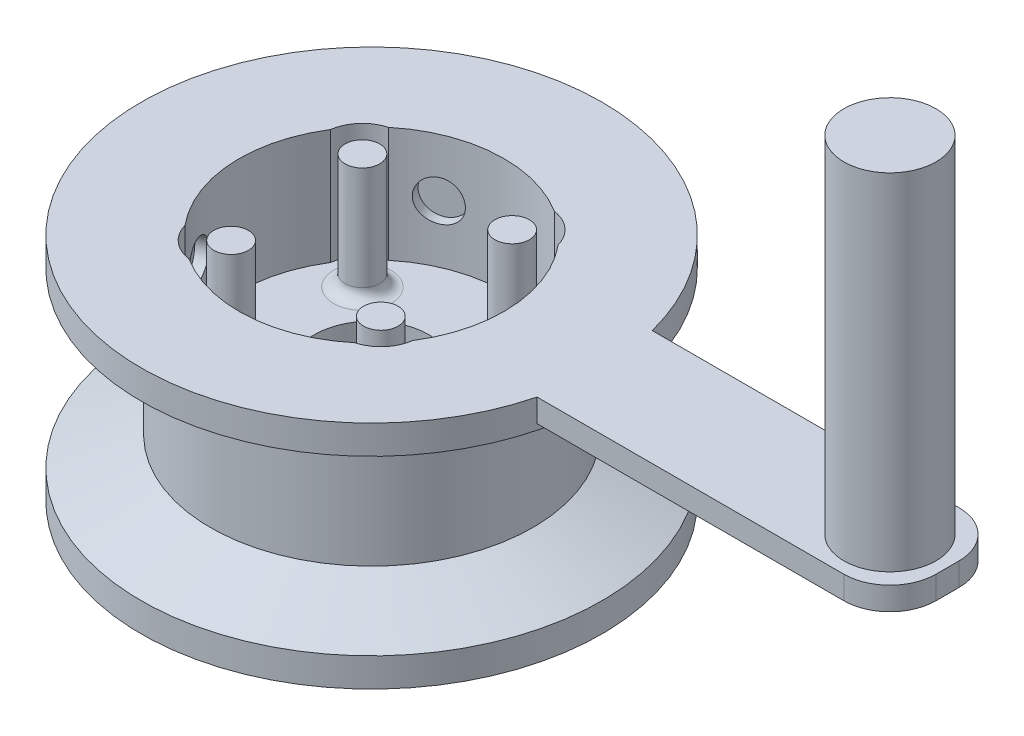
ISO-10303-21;
HEADER;
FILE_DESCRIPTION(('STEP AP214'),'2;1');
FILE_NAME('part.step','',(''),(''),'','','');
FILE_SCHEMA(('AUTOMOTIVE_DESIGN { 1 0 10303 214 1 1 1 1 }'));
ENDSEC;
DATA;
#1=APPLICATION_CONTEXT('core data for automotive mechanical design processes');
#2=APPLICATION_PROTOCOL_DEFINITION('international standard','automotive_design',2000,#1);
#3=PRODUCT_CONTEXT('',#1,'mechanical');
#4=PRODUCT('Part','Part','',(#3));
#5=PRODUCT_RELATED_PRODUCT_CATEGORY('part','',(#4));
#6=PRODUCT_DEFINITION_FORMATION('','',#4);
#7=PRODUCT_DEFINITION_CONTEXT('part definition',#1,'design');
#8=PRODUCT_DEFINITION('design','',#6,#7);
#9=PRODUCT_DEFINITION_SHAPE('','',#8);
#10=(LENGTH_UNIT() NAMED_UNIT(*) SI_UNIT(.MILLI.,.METRE.));
#11=(NAMED_UNIT(*) PLANE_ANGLE_UNIT() SI_UNIT($,.RADIAN.));
#12=(NAMED_UNIT(*) SI_UNIT($,.STERADIAN.) SOLID_ANGLE_UNIT());
#13=UNCERTAINTY_MEASURE_WITH_UNIT(LENGTH_MEASURE(1.E-05),#10,'distance_accuracy_value','');
#14=(GEOMETRIC_REPRESENTATION_CONTEXT(3) GLOBAL_UNCERTAINTY_ASSIGNED_CONTEXT((#13)) GLOBAL_UNIT_ASSIGNED_CONTEXT((#10,
#11,#12)) REPRESENTATION_CONTEXT('',''));
#15=CARTESIAN_POINT('',(0.,0.,0.));
#16=DIRECTION('',(0.,0.,1.));
#17=DIRECTION('',(1.,0.,0.));
#18=AXIS2_PLACEMENT_3D('',#15,#16,#17);
#19=CARTESIAN_POINT('',(0.,0.,0.));
#20=DIRECTION('',(0.,-1.,0.));
#21=DIRECTION('',(0.,0.,-1.));
#22=AXIS2_PLACEMENT_3D('',#19,#20,#21);
#23=CYLINDRICAL_SURFACE('',#22,29.21);
#24=CARTESIAN_POINT('',(28.2199455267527,38.1,-7.54047574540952));
#25=CARTESIAN_POINT('',(28.2199452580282,38.3481217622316,-7.54048678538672));
#26=CARTESIAN_POINT('',(28.2145226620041,38.5963864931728,-7.56086173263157));
#27=CARTESIAN_POINT('',(28.1927354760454,39.0859716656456,-7.64169164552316));
#28=CARTESIAN_POINT('',(28.17636028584,39.3272851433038,-7.70218543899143));
#29=CARTESIAN_POINT('',(28.1324418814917,39.7958104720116,-7.86107895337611));
#30=CARTESIAN_POINT('',(28.1049073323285,40.0230331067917,-7.95944926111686));
#31=CARTESIAN_POINT('',(28.0383691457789,40.4572516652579,-8.1907490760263));
#32=CARTESIAN_POINT('',(27.9993670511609,40.6642503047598,-8.32367393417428));
#33=CARTESIAN_POINT('',(27.9092949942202,41.0538809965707,-8.62088001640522));
#34=CARTESIAN_POINT('',(27.858138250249,41.2363223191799,-8.78538501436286));
#35=CARTESIAN_POINT('',(27.7438403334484,41.570006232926,-9.13991491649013));
#36=CARTESIAN_POINT('',(27.6806984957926,41.7212470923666,-9.32994123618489));
#37=CARTESIAN_POINT('',(27.5423956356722,41.9889421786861,-9.73065358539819));
#38=CARTESIAN_POINT('',(27.467176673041,42.1052205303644,-9.9414372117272));
#39=CARTESIAN_POINT('',(27.3058296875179,42.2985610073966,-10.3763917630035));
#40=CARTESIAN_POINT('',(27.2197022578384,42.375625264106,-10.6005619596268));
#41=CARTESIAN_POINT('',(27.0388336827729,42.4877711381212,-11.0537143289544));
#42=CARTESIAN_POINT('',(26.944164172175,42.5231722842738,-11.2826459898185));
#43=CARTESIAN_POINT('',(26.7479652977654,42.551979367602,-11.7402042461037));
#44=CARTESIAN_POINT('',(26.646436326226,42.5453877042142,-11.9688308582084));
#45=CARTESIAN_POINT('',(26.4403887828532,42.4906480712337,-12.4173415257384));
#46=CARTESIAN_POINT('',(26.3359018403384,42.4428438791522,-12.6372822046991));
#47=CARTESIAN_POINT('',(26.1266294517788,42.3075760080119,-13.0644533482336));
#48=CARTESIAN_POINT('',(26.0218439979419,42.2201112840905,-13.2716834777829));
#49=CARTESIAN_POINT('',(25.815418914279,42.0076545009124,-13.668891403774));
#50=CARTESIAN_POINT('',(25.7137930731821,41.8825181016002,-13.8587991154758));
#51=CARTESIAN_POINT('',(25.5181450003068,41.5983755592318,-14.2158321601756));
#52=CARTESIAN_POINT('',(25.4241232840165,41.439367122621,-14.3829559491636));
#53=CARTESIAN_POINT('',(25.2467667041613,41.0900801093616,-14.6920730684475));
#54=CARTESIAN_POINT('',(25.1635496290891,40.8995013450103,-14.8337949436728));
#55=CARTESIAN_POINT('',(25.012746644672,40.4935023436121,-15.0866945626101));
#56=CARTESIAN_POINT('',(24.9451608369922,40.2780819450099,-15.1978721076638));
#57=CARTESIAN_POINT('',(24.8288556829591,39.8282019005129,-15.3871516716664));
#58=CARTESIAN_POINT('',(24.7801518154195,39.5937268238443,-15.4652265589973));
#59=CARTESIAN_POINT('',(24.7041913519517,39.1125635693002,-15.5862819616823));
#60=CARTESIAN_POINT('',(24.6769331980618,38.8658762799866,-15.6292650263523));
#61=CARTESIAN_POINT('',(24.6454673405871,38.369925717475,-15.6788362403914));
#62=CARTESIAN_POINT('',(24.6410324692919,38.1207126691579,-15.68578307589));
#63=CARTESIAN_POINT('',(24.6548342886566,37.6244811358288,-15.6640800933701));
#64=CARTESIAN_POINT('',(24.6730702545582,37.3774625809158,-15.6354314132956));
#65=CARTESIAN_POINT('',(24.7310998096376,36.8939365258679,-15.5434778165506));
#66=CARTESIAN_POINT('',(24.7707814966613,36.6573813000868,-15.4803527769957));
#67=CARTESIAN_POINT('',(24.8696208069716,36.1999905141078,-15.321057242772));
#68=CARTESIAN_POINT('',(24.9287794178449,35.9791557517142,-15.2248850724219));
#69=CARTESIAN_POINT('',(25.0642400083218,35.5575946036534,-15.0008392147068));
#70=CARTESIAN_POINT('',(25.1406711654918,35.357037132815,-14.872725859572));
#71=CARTESIAN_POINT('',(25.3068713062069,34.983461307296,-14.5881271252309));
#72=CARTESIAN_POINT('',(25.396641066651,34.8104445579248,-14.4316400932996));
#73=CARTESIAN_POINT('',(25.586410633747,34.4953508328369,-14.0924697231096));
#74=CARTESIAN_POINT('',(25.6864916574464,34.3535522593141,-13.9095730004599));
#75=CARTESIAN_POINT('',(25.8920471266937,34.1068609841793,-13.523085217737));
#76=CARTESIAN_POINT('',(25.9975214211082,34.0019672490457,-13.3194947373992));
#77=CARTESIAN_POINT('',(26.2093421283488,33.8325065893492,-12.8976713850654));
#78=CARTESIAN_POINT('',(26.3156837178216,33.7677882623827,-12.6794969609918));
#79=CARTESIAN_POINT('',(26.5258368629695,33.6800258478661,-12.2337545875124));
#80=CARTESIAN_POINT('',(26.629648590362,33.6569789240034,-12.0061872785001));
#81=CARTESIAN_POINT('',(26.8304335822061,33.6532843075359,-11.5504682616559));
#82=CARTESIAN_POINT('',(26.9274653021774,33.6722109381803,-11.3223456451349));
#83=CARTESIAN_POINT('',(27.1132851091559,33.7510127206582,-10.8698533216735));
#84=CARTESIAN_POINT('',(27.2020732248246,33.810887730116,-10.6454836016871));
#85=CARTESIAN_POINT('',(27.3695193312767,33.969734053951,-10.2072784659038));
#86=CARTESIAN_POINT('',(27.4481851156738,34.0686750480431,-9.9934350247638));
#87=CARTESIAN_POINT('',(27.5943602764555,34.3027991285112,-9.58243268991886));
#88=CARTESIAN_POINT('',(27.6618692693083,34.4379834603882,-9.38527436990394));
#89=CARTESIAN_POINT('',(27.7858133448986,34.7422922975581,-9.0117606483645));
#90=CARTESIAN_POINT('',(27.8421356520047,34.9117307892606,-8.83562361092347));
#91=CARTESIAN_POINT('',(27.9428267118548,35.2790776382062,-8.51183655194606));
#92=CARTESIAN_POINT('',(27.9871926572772,35.47699266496,-8.36419322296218));
#93=CARTESIAN_POINT('',(28.0643828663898,35.8970250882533,-8.10144623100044));
#94=CARTESIAN_POINT('',(28.0971387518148,36.1192760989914,-7.98653610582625));
#95=CARTESIAN_POINT('',(28.1510423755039,36.5806510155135,-7.79441822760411));
#96=CARTESIAN_POINT('',(28.1722021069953,36.819757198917,-7.71717153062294));
#97=CARTESIAN_POINT('',(28.1984888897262,37.2332665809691,-7.62042896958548));
#98=CARTESIAN_POINT('',(28.2065390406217,37.4051217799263,-7.5904998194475));
#99=CARTESIAN_POINT('',(28.2172674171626,37.7512944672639,-7.55051946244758));
#100=CARTESIAN_POINT('',(28.2199457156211,37.9256119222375,-7.540467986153));
#101=CARTESIAN_POINT('',(28.2199455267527,38.1,-7.54047574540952));
#102=B_SPLINE_CURVE_WITH_KNOTS('',3,(#24,#25,#26,#27,#28,#29,#30,#31,#32,#33,#34,#35,#36,#37,
#38,#39,#40,#41,#42,#43,#44,#45,#46,#47,#48,#49,#50,#51,#52,#53,#54,#55,#56,#57,#58,#59,#60,#61,
#62,#63,#64,#65,#66,#67,#68,#69,#70,#71,#72,#73,#74,#75,#76,#77,#78,#79,#80,#81,#82,#83,#84,#85,
#86,#87,#88,#89,#90,#91,#92,#93,#94,#95,#96,#97,#98,#99,#100,#101),.UNSPECIFIED.,.T.,.F.,(4,2,2,
2,2,2,2,2,2,2,2,2,2,2,2,2,2,2,2,2,2,2,2,2,2,2,2,2,2,2,2,2,2,2,2,2,2,2,4),(0.,0.743727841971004,
1.48817653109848,2.23204827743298,2.9758199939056,3.72507071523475,4.47436301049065,
5.22736379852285,5.98032365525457,6.72747037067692,7.47457439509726,8.21550603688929,
8.95645719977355,9.70028427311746,10.4441617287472,11.1955677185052,11.9469785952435,
12.6990041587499,13.4509750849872,14.1954467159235,14.9398945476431,15.6804948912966,
16.4211327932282,17.1675046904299,17.9139200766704,18.6667441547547,19.4195471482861,
20.169495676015,20.9193931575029,21.6617203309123,22.4040449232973,23.1457945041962,
23.8875695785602,24.6364803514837,25.3855668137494,26.1389945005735,26.8916414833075,
27.4143647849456,27.9370810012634),.UNSPECIFIED.);
#103=CARTESIAN_POINT('',(28.2199455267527,38.1,-7.54047574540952));
#104=VERTEX_POINT('',#103);
#105=EDGE_CURVE('E53',#104,#104,#102,.T.);
#106=ORIENTED_EDGE('',*,*,#105,.F.);
#107=EDGE_LOOP('',(#106));
#108=FACE_BOUND('',#107,.T.);
#109=CARTESIAN_POINT('',(0.,50.8,0.));
#110=DIRECTION('',(0.,-1.,0.));
#111=DIRECTION('',(0.,0.,-1.));
#112=AXIS2_PLACEMENT_3D('',#109,#110,#111);
#113=CIRCLE('',#112,29.21);
#114=CARTESIAN_POINT('',(22.4360381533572,50.8,-18.704231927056));
#115=VERTEX_POINT('',#114);
#116=CARTESIAN_POINT('',(24.6864293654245,50.8,15.614234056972));
#117=VERTEX_POINT('',#116);
#118=EDGE_CURVE('E181',#115,#117,#113,.T.);
#119=ORIENTED_EDGE('',*,*,#118,.F.);
#120=DIRECTION('',(0.,1.,0.));
#121=VECTOR('',#120,1.);
#122=CARTESIAN_POINT('',(22.4360381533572,16.3267592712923,-18.704231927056));
#123=LINE('',#122,#121);
#124=CARTESIAN_POINT('',(22.4360381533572,25.4,-18.704231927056));
#125=VERTEX_POINT('',#124);
#126=EDGE_CURVE('E161',#125,#115,#123,.T.);
#127=ORIENTED_EDGE('',*,*,#126,.F.);
#128=CARTESIAN_POINT('',(0.,25.4,0.));
#129=DIRECTION('',(0.,-1.,0.));
#130=DIRECTION('',(0.,0.,-1.));
#131=AXIS2_PLACEMENT_3D('',#128,#129,#130);
#132=CIRCLE('',#131,29.21);
#133=CARTESIAN_POINT('',(24.6864293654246,25.4,15.614234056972));
#134=VERTEX_POINT('',#133);
#135=EDGE_CURVE('E310',#134,#125,#132,.F.);
#136=ORIENTED_EDGE('',*,*,#135,.F.);
#137=DIRECTION('',(0.,1.,0.));
#138=VECTOR('',#137,1.);
#139=CARTESIAN_POINT('',(24.6864293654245,16.3267592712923,15.614234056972));
#140=LINE('',#139,#138);
#141=EDGE_CURVE('E297',#134,#117,#140,.T.);
#142=ORIENTED_EDGE('',*,*,#141,.T.);
#143=EDGE_LOOP('',(#119,#127,#136,#142));
#144=FACE_BOUND('',#143,.T.);
#145=ADVANCED_FACE('F49',(#108,#144),#23,.F.);
#146=CARTESIAN_POINT('',(7.54047574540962,38.1,28.2199455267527));
#147=CARTESIAN_POINT('',(7.54048678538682,38.3481217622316,28.2199452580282));
#148=CARTESIAN_POINT('',(7.56086173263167,38.5963864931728,28.214522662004));
#149=CARTESIAN_POINT('',(7.64169164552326,39.0859716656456,28.1927354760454));
#150=CARTESIAN_POINT('',(7.70218543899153,39.3272851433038,28.17636028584));
#151=CARTESIAN_POINT('',(7.8610789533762,39.7958104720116,28.1324418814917));
#152=CARTESIAN_POINT('',(7.95944926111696,40.0230331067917,28.1049073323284));
#153=CARTESIAN_POINT('',(8.19074907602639,40.4572516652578,28.0383691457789));
#154=CARTESIAN_POINT('',(8.32367393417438,40.6642503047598,27.9993670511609));
#155=CARTESIAN_POINT('',(8.62088001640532,41.0538809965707,27.9092949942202));
#156=CARTESIAN_POINT('',(8.78538501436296,41.2363223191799,27.8581382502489));
#157=CARTESIAN_POINT('',(9.13991491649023,41.570006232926,27.7438403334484));
#158=CARTESIAN_POINT('',(9.32994123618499,41.7212470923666,27.6806984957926));
#159=CARTESIAN_POINT('',(9.73065358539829,41.9889421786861,27.5423956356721));
#160=CARTESIAN_POINT('',(9.9414372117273,42.1052205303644,27.467176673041));
#161=CARTESIAN_POINT('',(10.3763917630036,42.2985610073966,27.3058296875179));
#162=CARTESIAN_POINT('',(10.6005619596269,42.375625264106,27.2197022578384));
#163=CARTESIAN_POINT('',(11.0537143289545,42.4877711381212,27.0388336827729));
#164=CARTESIAN_POINT('',(11.2826459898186,42.5231722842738,26.944164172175));
#165=CARTESIAN_POINT('',(11.7402042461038,42.551979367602,26.7479652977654));
#166=CARTESIAN_POINT('',(11.9688308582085,42.5453877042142,26.6464363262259));
#167=CARTESIAN_POINT('',(12.4173415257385,42.4906480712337,26.4403887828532));
#168=CARTESIAN_POINT('',(12.6372822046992,42.4428438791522,26.3359018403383));
#169=CARTESIAN_POINT('',(13.0644533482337,42.3075760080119,26.1266294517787));
#170=CARTESIAN_POINT('',(13.2716834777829,42.2201112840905,26.0218439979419));
#171=CARTESIAN_POINT('',(13.6688914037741,42.0076545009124,25.815418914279));
#172=CARTESIAN_POINT('',(13.8587991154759,41.8825181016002,25.7137930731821));
#173=CARTESIAN_POINT('',(14.2158321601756,41.5983755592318,25.5181450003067));
#174=CARTESIAN_POINT('',(14.3829559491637,41.439367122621,25.4241232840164));
#175=CARTESIAN_POINT('',(14.6920730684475,41.0900801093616,25.2467667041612));
#176=CARTESIAN_POINT('',(14.8337949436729,40.8995013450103,25.1635496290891));
#177=CARTESIAN_POINT('',(15.0866945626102,40.4935023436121,25.0127466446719));
#178=CARTESIAN_POINT('',(15.1978721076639,40.2780819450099,24.9451608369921));
#179=CARTESIAN_POINT('',(15.3871516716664,39.8282019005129,24.828855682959));
#180=CARTESIAN_POINT('',(15.4652265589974,39.5937268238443,24.7801518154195));
#181=CARTESIAN_POINT('',(15.5862819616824,39.1125635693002,24.7041913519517));
#182=CARTESIAN_POINT('',(15.6292650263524,38.8658762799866,24.6769331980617));
#183=CARTESIAN_POINT('',(15.6788362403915,38.369925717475,24.645467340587));
#184=CARTESIAN_POINT('',(15.6857830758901,38.1207126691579,24.6410324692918));
#185=CARTESIAN_POINT('',(15.6640800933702,37.6244811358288,24.6548342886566));
#186=CARTESIAN_POINT('',(15.6354314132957,37.3774625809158,24.6730702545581));
#187=CARTESIAN_POINT('',(15.5434778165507,36.8939365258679,24.7310998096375));
#188=CARTESIAN_POINT('',(15.4803527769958,36.6573813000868,24.7707814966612));
#189=CARTESIAN_POINT('',(15.3210572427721,36.1999905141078,24.8696208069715));
#190=CARTESIAN_POINT('',(15.224885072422,35.9791557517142,24.9287794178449));
#191=CARTESIAN_POINT('',(15.0008392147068,35.5575946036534,25.0642400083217));
#192=CARTESIAN_POINT('',(14.8727258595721,35.357037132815,25.1406711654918));
#193=CARTESIAN_POINT('',(14.588127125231,34.983461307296,25.3068713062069));
#194=CARTESIAN_POINT('',(14.4316400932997,34.8104445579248,25.3966410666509));
#195=CARTESIAN_POINT('',(14.0924697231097,34.4953508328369,25.586410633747));
#196=CARTESIAN_POINT('',(13.90957300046,34.3535522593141,25.6864916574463));
#197=CARTESIAN_POINT('',(13.523085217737,34.1068609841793,25.8920471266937));
#198=CARTESIAN_POINT('',(13.3194947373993,34.0019672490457,25.9975214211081));
#199=CARTESIAN_POINT('',(12.8976713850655,33.8325065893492,26.2093421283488));
#200=CARTESIAN_POINT('',(12.6794969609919,33.7677882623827,26.3156837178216));
#201=CARTESIAN_POINT('',(12.2337545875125,33.6800258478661,26.5258368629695));
#202=CARTESIAN_POINT('',(12.0061872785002,33.6569789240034,26.629648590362));
#203=CARTESIAN_POINT('',(11.550468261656,33.6532843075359,26.8304335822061));
#204=CARTESIAN_POINT('',(11.322345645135,33.6722109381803,26.9274653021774));
#205=CARTESIAN_POINT('',(10.8698533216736,33.7510127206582,27.1132851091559));
#206=CARTESIAN_POINT('',(10.6454836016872,33.810887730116,27.2020732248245));
#207=CARTESIAN_POINT('',(10.2072784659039,33.969734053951,27.3695193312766));
#208=CARTESIAN_POINT('',(9.99343502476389,34.0686750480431,27.4481851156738));
#209=CARTESIAN_POINT('',(9.58243268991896,34.3027991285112,27.5943602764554));
#210=CARTESIAN_POINT('',(9.38527436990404,34.4379834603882,27.6618692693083));
#211=CARTESIAN_POINT('',(9.0117606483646,34.7422922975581,27.7858133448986));
#212=CARTESIAN_POINT('',(8.83562361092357,34.9117307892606,27.8421356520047));
#213=CARTESIAN_POINT('',(8.51183655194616,35.2790776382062,27.9428267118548));
#214=CARTESIAN_POINT('',(8.36419322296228,35.47699266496,27.9871926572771));
#215=CARTESIAN_POINT('',(8.10144623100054,35.8970250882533,28.0643828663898));
#216=CARTESIAN_POINT('',(7.98653610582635,36.1192760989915,28.0971387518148));
#217=CARTESIAN_POINT('',(7.79441822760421,36.5806510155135,28.1510423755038));
#218=CARTESIAN_POINT('',(7.71717153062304,36.819757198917,28.1722021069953));
#219=CARTESIAN_POINT('',(7.62042896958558,37.2332665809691,28.1984888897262));
#220=CARTESIAN_POINT('',(7.5904998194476,37.4051217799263,28.2065390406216));
#221=CARTESIAN_POINT('',(7.55051946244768,37.7512944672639,28.2172674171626));
#222=CARTESIAN_POINT('',(7.5404679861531,37.9256119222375,28.2199457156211));
#223=CARTESIAN_POINT('',(7.54047574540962,38.1,28.2199455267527));
#224=B_SPLINE_CURVE_WITH_KNOTS('',3,(#146,#147,#148,#149,#150,#151,#152,#153,#154,#155,#156,
#157,#158,#159,#160,#161,#162,#163,#164,#165,#166,#167,#168,#169,#170,#171,#172,#173,#174,#175,
#176,#177,#178,#179,#180,#181,#182,#183,#184,#185,#186,#187,#188,#189,#190,#191,#192,#193,#194,
#195,#196,#197,#198,#199,#200,#201,#202,#203,#204,#205,#206,#207,#208,#209,#210,#211,#212,#213,
#214,#215,#216,#217,#218,#219,#220,#221,#222,#223),.UNSPECIFIED.,.T.,.F.,(4,2,2,2,2,2,2,2,2,2,2,
2,2,2,2,2,2,2,2,2,2,2,2,2,2,2,2,2,2,2,2,2,2,2,2,2,2,2,4),(0.,0.743727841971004,1.48817653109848,
2.23204827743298,2.97581999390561,3.72507071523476,4.47436301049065,5.22736379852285,
5.98032365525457,6.72747037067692,7.47457439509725,8.21550603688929,8.95645719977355,
9.70028427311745,10.4441617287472,11.1955677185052,11.9469785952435,12.6990041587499,
13.4509750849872,14.1954467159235,14.9398945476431,15.6804948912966,16.4211327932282,
17.1675046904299,17.9139200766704,18.6667441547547,19.4195471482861,20.169495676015,
20.9193931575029,21.6617203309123,22.4040449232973,23.1457945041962,23.8875695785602,
24.6364803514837,25.3855668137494,26.1389945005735,26.8916414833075,27.4143647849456,
27.9370810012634),.UNSPECIFIED.);
#225=CARTESIAN_POINT('',(7.54047574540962,38.1,28.2199455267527));
#226=VERTEX_POINT('',#225);
#227=EDGE_CURVE('E522',#226,#226,#224,.T.);
#228=ORIENTED_EDGE('',*,*,#227,.F.);
#229=EDGE_LOOP('',(#228));
#230=FACE_BOUND('',#229,.T.);
#231=CARTESIAN_POINT('',(18.7042319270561,50.8,22.4360381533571));
#232=VERTEX_POINT('',#231);
#233=CARTESIAN_POINT('',(-15.6142340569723,50.8,24.6864293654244));
#234=VERTEX_POINT('',#233);
#235=EDGE_CURVE('E187',#232,#234,#113,.T.);
#236=ORIENTED_EDGE('',*,*,#235,.F.);
#237=DIRECTION('',(0.,1.,0.));
#238=VECTOR('',#237,1.);
#239=CARTESIAN_POINT('',(18.7042319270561,16.3267592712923,22.4360381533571));
#240=LINE('',#239,#238);
#241=CARTESIAN_POINT('',(18.7042319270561,25.4,22.4360381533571));
#242=VERTEX_POINT('',#241);
#243=EDGE_CURVE('E166',#242,#232,#240,.T.);
#244=ORIENTED_EDGE('',*,*,#243,.F.);
#245=CARTESIAN_POINT('',(-15.6142340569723,25.4,24.6864293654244));
#246=VERTEX_POINT('',#245);
#247=EDGE_CURVE('E311',#246,#242,#132,.F.);
#248=ORIENTED_EDGE('',*,*,#247,.F.);
#249=DIRECTION('',(0.,1.,0.));
#250=VECTOR('',#249,1.);
#251=CARTESIAN_POINT('',(-15.6142340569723,16.3267592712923,24.6864293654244));
#252=LINE('',#251,#250);
#253=EDGE_CURVE('E289',#246,#234,#252,.T.);
#254=ORIENTED_EDGE('',*,*,#253,.T.);
#255=EDGE_LOOP('',(#236,#244,#248,#254));
#256=FACE_BOUND('',#255,.T.);
#257=ADVANCED_FACE('F461',(#230,#256),#23,.F.);
#258=CARTESIAN_POINT('',(-28.2199455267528,38.1,7.54047574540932));
#259=CARTESIAN_POINT('',(-28.2199452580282,38.3481217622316,7.54048678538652));
#260=CARTESIAN_POINT('',(-28.2145226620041,38.5963864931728,7.56086173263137));
#261=CARTESIAN_POINT('',(-28.1927354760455,39.0859716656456,7.64169164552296));
#262=CARTESIAN_POINT('',(-28.1763602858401,39.3272851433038,7.70218543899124));
#263=CARTESIAN_POINT('',(-28.1324418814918,39.7958104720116,7.86107895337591));
#264=CARTESIAN_POINT('',(-28.1049073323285,40.0230331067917,7.95944926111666));
#265=CARTESIAN_POINT('',(-28.038369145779,40.4572516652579,8.1907490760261));
#266=CARTESIAN_POINT('',(-27.999367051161,40.6642503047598,8.32367393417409));
#267=CARTESIAN_POINT('',(-27.9092949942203,41.0538809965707,8.62088001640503));
#268=CARTESIAN_POINT('',(-27.858138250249,41.2363223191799,8.78538501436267));
#269=CARTESIAN_POINT('',(-27.7438403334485,41.570006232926,9.13991491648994));
#270=CARTESIAN_POINT('',(-27.6806984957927,41.7212470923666,9.3299412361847));
#271=CARTESIAN_POINT('',(-27.5423956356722,41.9889421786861,9.730653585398));
#272=CARTESIAN_POINT('',(-27.4671766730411,42.1052205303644,9.94143721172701));
#273=CARTESIAN_POINT('',(-27.305829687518,42.2985610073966,10.3763917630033));
#274=CARTESIAN_POINT('',(-27.2197022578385,42.375625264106,10.6005619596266));
#275=CARTESIAN_POINT('',(-27.038833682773,42.4877711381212,11.0537143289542));
#276=CARTESIAN_POINT('',(-26.9441641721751,42.5231722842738,11.2826459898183));
#277=CARTESIAN_POINT('',(-26.7479652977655,42.551979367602,11.7402042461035));
#278=CARTESIAN_POINT('',(-26.646436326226,42.5453877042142,11.9688308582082));
#279=CARTESIAN_POINT('',(-26.4403887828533,42.4906480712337,12.4173415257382));
#280=CARTESIAN_POINT('',(-26.3359018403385,42.4428438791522,12.6372822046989));
#281=CARTESIAN_POINT('',(-26.1266294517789,42.3075760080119,13.0644533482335));
#282=CARTESIAN_POINT('',(-26.021843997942,42.2201112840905,13.2716834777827));
#283=CARTESIAN_POINT('',(-25.8154189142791,42.0076545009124,13.6688914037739));
#284=CARTESIAN_POINT('',(-25.7137930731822,41.8825181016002,13.8587991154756));
#285=CARTESIAN_POINT('',(-25.5181450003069,41.5983755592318,14.2158321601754));
#286=CARTESIAN_POINT('',(-25.4241232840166,41.439367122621,14.3829559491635));
#287=CARTESIAN_POINT('',(-25.2467667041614,41.0900801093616,14.6920730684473));
#288=CARTESIAN_POINT('',(-25.1635496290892,40.8995013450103,14.8337949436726));
#289=CARTESIAN_POINT('',(-25.0127466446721,40.4935023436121,15.0866945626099));
#290=CARTESIAN_POINT('',(-24.9451608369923,40.2780819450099,15.1978721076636));
#291=CARTESIAN_POINT('',(-24.8288556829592,39.8282019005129,15.3871516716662));
#292=CARTESIAN_POINT('',(-24.7801518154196,39.5937268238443,15.4652265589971));
#293=CARTESIAN_POINT('',(-24.7041913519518,39.1125635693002,15.5862819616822));
#294=CARTESIAN_POINT('',(-24.6769331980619,38.8658762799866,15.6292650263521));
#295=CARTESIAN_POINT('',(-24.6454673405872,38.369925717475,15.6788362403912));
#296=CARTESIAN_POINT('',(-24.641032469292,38.1207126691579,15.6857830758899));
#297=CARTESIAN_POINT('',(-24.6548342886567,37.6244811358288,15.6640800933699));
#298=CARTESIAN_POINT('',(-24.6730702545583,37.3774625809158,15.6354314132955));
#299=CARTESIAN_POINT('',(-24.7310998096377,36.8939365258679,15.5434778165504));
#300=CARTESIAN_POINT('',(-24.7707814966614,36.6573813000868,15.4803527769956));
#301=CARTESIAN_POINT('',(-24.8696208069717,36.1999905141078,15.3210572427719));
#302=CARTESIAN_POINT('',(-24.928779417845,35.9791557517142,15.2248850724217));
#303=CARTESIAN_POINT('',(-25.0642400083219,35.5575946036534,15.0008392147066));
#304=CARTESIAN_POINT('',(-25.1406711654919,35.357037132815,14.8727258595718));
#305=CARTESIAN_POINT('',(-25.306871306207,34.983461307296,14.5881271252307));
#306=CARTESIAN_POINT('',(-25.3966410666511,34.8104445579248,14.4316400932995));
#307=CARTESIAN_POINT('',(-25.5864106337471,34.4953508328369,14.0924697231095));
#308=CARTESIAN_POINT('',(-25.6864916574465,34.3535522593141,13.9095730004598));
#309=CARTESIAN_POINT('',(-25.8920471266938,34.1068609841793,13.5230852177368));
#310=CARTESIAN_POINT('',(-25.9975214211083,34.0019672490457,13.319494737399));
#311=CARTESIAN_POINT('',(-26.2093421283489,33.8325065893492,12.8976713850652));
#312=CARTESIAN_POINT('',(-26.3156837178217,33.7677882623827,12.6794969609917));
#313=CARTESIAN_POINT('',(-26.5258368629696,33.6800258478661,12.2337545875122));
#314=CARTESIAN_POINT('',(-26.6296485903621,33.6569789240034,12.0061872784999));
#315=CARTESIAN_POINT('',(-26.8304335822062,33.6532843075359,11.5504682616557));
#316=CARTESIAN_POINT('',(-26.9274653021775,33.6722109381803,11.3223456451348));
#317=CARTESIAN_POINT('',(-27.113285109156,33.7510127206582,10.8698533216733));
#318=CARTESIAN_POINT('',(-27.2020732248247,33.810887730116,10.6454836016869));
#319=CARTESIAN_POINT('',(-27.3695193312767,33.969734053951,10.2072784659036));
#320=CARTESIAN_POINT('',(-27.4481851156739,34.0686750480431,9.9934350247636));
#321=CARTESIAN_POINT('',(-27.5943602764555,34.3027991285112,9.58243268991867));
#322=CARTESIAN_POINT('',(-27.6618692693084,34.4379834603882,9.38527436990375));
#323=CARTESIAN_POINT('',(-27.7858133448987,34.7422922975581,9.01176064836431));
#324=CARTESIAN_POINT('',(-27.8421356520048,34.9117307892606,8.83562361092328));
#325=CARTESIAN_POINT('',(-27.9428267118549,35.2790776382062,8.51183655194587));
#326=CARTESIAN_POINT('',(-27.9871926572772,35.47699266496,8.36419322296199));
#327=CARTESIAN_POINT('',(-28.0643828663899,35.8970250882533,8.10144623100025));
#328=CARTESIAN_POINT('',(-28.0971387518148,36.1192760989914,7.98653610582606));
#329=CARTESIAN_POINT('',(-28.1510423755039,36.5806510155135,7.79441822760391));
#330=CARTESIAN_POINT('',(-28.1722021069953,36.819757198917,7.71717153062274));
#331=CARTESIAN_POINT('',(-28.1984888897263,37.2332665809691,7.62042896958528));
#332=CARTESIAN_POINT('',(-28.2065390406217,37.4051217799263,7.59049981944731));
#333=CARTESIAN_POINT('',(-28.2172674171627,37.7512944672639,7.55051946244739));
#334=CARTESIAN_POINT('',(-28.2199457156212,37.9256119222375,7.5404679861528));
#335=CARTESIAN_POINT('',(-28.2199455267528,38.1,7.54047574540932));
#336=B_SPLINE_CURVE_WITH_KNOTS('',3,(#258,#259,#260,#261,#262,#263,#264,#265,#266,#267,#268,
#269,#270,#271,#272,#273,#274,#275,#276,#277,#278,#279,#280,#281,#282,#283,#284,#285,#286,#287,
#288,#289,#290,#291,#292,#293,#294,#295,#296,#297,#298,#299,#300,#301,#302,#303,#304,#305,#306,
#307,#308,#309,#310,#311,#312,#313,#314,#315,#316,#317,#318,#319,#320,#321,#322,#323,#324,#325,
#326,#327,#328,#329,#330,#331,#332,#333,#334,#335),.UNSPECIFIED.,.T.,.F.,(4,2,2,2,2,2,2,2,2,2,2,
2,2,2,2,2,2,2,2,2,2,2,2,2,2,2,2,2,2,2,2,2,2,2,2,2,2,2,4),(0.,0.743727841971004,1.48817653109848,
2.23204827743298,2.97581999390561,3.72507071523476,4.47436301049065,5.22736379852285,
5.98032365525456,6.72747037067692,7.47457439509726,8.21550603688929,8.95645719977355,
9.70028427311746,10.4441617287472,11.1955677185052,11.9469785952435,12.6990041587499,
13.4509750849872,14.1954467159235,14.9398945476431,15.6804948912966,16.4211327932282,
17.1675046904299,17.9139200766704,18.6667441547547,19.4195471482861,20.169495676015,
20.9193931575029,21.6617203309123,22.4040449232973,23.1457945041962,23.8875695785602,
24.6364803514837,25.3855668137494,26.1389945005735,26.8916414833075,27.4143647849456,
27.9370810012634),.UNSPECIFIED.);
#337=CARTESIAN_POINT('',(-28.2199455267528,38.1,7.54047574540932));
#338=VERTEX_POINT('',#337);
#339=EDGE_CURVE('E278',#338,#338,#336,.T.);
#340=ORIENTED_EDGE('',*,*,#339,.F.);
#341=EDGE_LOOP('',(#340));
#342=FACE_BOUND('',#341,.T.);
#343=CARTESIAN_POINT('',(-22.4360381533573,50.8,18.7042319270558));
#344=VERTEX_POINT('',#343);
#345=CARTESIAN_POINT('',(-24.6864293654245,50.8,-15.614234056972));
#346=VERTEX_POINT('',#345);
#347=EDGE_CURVE('E183',#344,#346,#113,.T.);
#348=ORIENTED_EDGE('',*,*,#347,.F.);
#349=DIRECTION('',(0.,1.,0.));
#350=VECTOR('',#349,1.);
#351=CARTESIAN_POINT('',(-22.4360381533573,16.3267592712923,18.7042319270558));
#352=LINE('',#351,#350);
#353=CARTESIAN_POINT('',(-22.4360381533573,25.4,18.7042319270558));
#354=VERTEX_POINT('',#353);
#355=EDGE_CURVE('E286',#354,#344,#352,.T.);
#356=ORIENTED_EDGE('',*,*,#355,.F.);
#357=CARTESIAN_POINT('',(-24.6864293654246,25.4,-15.614234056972));
#358=VERTEX_POINT('',#357);
#359=EDGE_CURVE('E313',#358,#354,#132,.F.);
#360=ORIENTED_EDGE('',*,*,#359,.F.);
#361=DIRECTION('',(0.,1.,0.));
#362=VECTOR('',#361,1.);
#363=CARTESIAN_POINT('',(-24.6864293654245,16.3267592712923,-15.614234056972));
#364=LINE('',#363,#362);
#365=EDGE_CURVE('E280',#358,#346,#364,.T.);
#366=ORIENTED_EDGE('',*,*,#365,.T.);
#367=EDGE_LOOP('',(#348,#356,#360,#366));
#368=FACE_BOUND('',#367,.T.);
#369=ADVANCED_FACE('F466',(#342,#368),#23,.F.);
#370=CARTESIAN_POINT('',(15.6142340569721,25.4,-24.6864293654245));
#371=VERTEX_POINT('',#370);
#372=CARTESIAN_POINT('',(-18.7042319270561,25.4,-22.4360381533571));
#373=VERTEX_POINT('',#372);
#374=EDGE_CURVE('E174',#371,#373,#132,.F.);
#375=ORIENTED_EDGE('',*,*,#374,.F.);
#376=DIRECTION('',(0.,1.,0.));
#377=VECTOR('',#376,1.);
#378=CARTESIAN_POINT('',(15.6142340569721,16.3267592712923,-24.6864293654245));
#379=LINE('',#378,#377);
#380=CARTESIAN_POINT('',(15.6142340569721,50.8,-24.6864293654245));
#381=VERTEX_POINT('',#380);
#382=EDGE_CURVE('E158',#371,#381,#379,.T.);
#383=ORIENTED_EDGE('',*,*,#382,.T.);
#384=CARTESIAN_POINT('',(-18.7042319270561,50.8,-22.4360381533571));
#385=VERTEX_POINT('',#384);
#386=EDGE_CURVE('E173',#385,#381,#113,.T.);
#387=ORIENTED_EDGE('',*,*,#386,.F.);
#388=DIRECTION('',(0.,1.,0.));
#389=VECTOR('',#388,1.);
#390=CARTESIAN_POINT('',(-18.7042319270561,16.3267592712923,-22.4360381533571));
#391=LINE('',#390,#389);
#392=EDGE_CURVE('E272',#373,#385,#391,.T.);
#393=ORIENTED_EDGE('',*,*,#392,.F.);
#394=EDGE_LOOP('',(#375,#383,#387,#393));
#395=FACE_BOUND('',#394,.T.);
#396=CARTESIAN_POINT('',(-7.54047574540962,38.1,-28.2199455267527));
#397=CARTESIAN_POINT('',(-7.54048678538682,38.3481217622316,-28.2199452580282));
#398=CARTESIAN_POINT('',(-7.56086173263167,38.5963864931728,-28.214522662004));
#399=CARTESIAN_POINT('',(-7.64169164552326,39.0859716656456,-28.1927354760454));
#400=CARTESIAN_POINT('',(-7.70218543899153,39.3272851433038,-28.17636028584));
#401=CARTESIAN_POINT('',(-7.8610789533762,39.7958104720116,-28.1324418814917));
#402=CARTESIAN_POINT('',(-7.95944926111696,40.0230331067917,-28.1049073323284));
#403=CARTESIAN_POINT('',(-8.19074907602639,40.4572516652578,-28.0383691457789));
#404=CARTESIAN_POINT('',(-8.32367393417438,40.6642503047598,-27.9993670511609));
#405=CARTESIAN_POINT('',(-8.62088001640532,41.0538809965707,-27.9092949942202));
#406=CARTESIAN_POINT('',(-8.78538501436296,41.2363223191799,-27.8581382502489));
#407=CARTESIAN_POINT('',(-9.13991491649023,41.570006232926,-27.7438403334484));
#408=CARTESIAN_POINT('',(-9.32994123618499,41.7212470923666,-27.6806984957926));
#409=CARTESIAN_POINT('',(-9.73065358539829,41.9889421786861,-27.5423956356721));
#410=CARTESIAN_POINT('',(-9.9414372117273,42.1052205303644,-27.467176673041));
#411=CARTESIAN_POINT('',(-10.3763917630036,42.2985610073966,-27.3058296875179));
#412=CARTESIAN_POINT('',(-10.6005619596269,42.375625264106,-27.2197022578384));
#413=CARTESIAN_POINT('',(-11.0537143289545,42.4877711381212,-27.0388336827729));
#414=CARTESIAN_POINT('',(-11.2826459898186,42.5231722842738,-26.944164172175));
#415=CARTESIAN_POINT('',(-11.7402042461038,42.551979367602,-26.7479652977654));
#416=CARTESIAN_POINT('',(-11.9688308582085,42.5453877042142,-26.6464363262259));
#417=CARTESIAN_POINT('',(-12.4173415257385,42.4906480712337,-26.4403887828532));
#418=CARTESIAN_POINT('',(-12.6372822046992,42.4428438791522,-26.3359018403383));
#419=CARTESIAN_POINT('',(-13.0644533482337,42.3075760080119,-26.1266294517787));
#420=CARTESIAN_POINT('',(-13.2716834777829,42.2201112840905,-26.0218439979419));
#421=CARTESIAN_POINT('',(-13.6688914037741,42.0076545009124,-25.815418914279));
#422=CARTESIAN_POINT('',(-13.8587991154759,41.8825181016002,-25.7137930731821));
#423=CARTESIAN_POINT('',(-14.2158321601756,41.5983755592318,-25.5181450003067));
#424=CARTESIAN_POINT('',(-14.3829559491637,41.439367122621,-25.4241232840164));
#425=CARTESIAN_POINT('',(-14.6920730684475,41.0900801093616,-25.2467667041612));
#426=CARTESIAN_POINT('',(-14.8337949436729,40.8995013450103,-25.1635496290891));
#427=CARTESIAN_POINT('',(-15.0866945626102,40.4935023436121,-25.0127466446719));
#428=CARTESIAN_POINT('',(-15.1978721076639,40.2780819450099,-24.9451608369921));
#429=CARTESIAN_POINT('',(-15.3871516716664,39.8282019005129,-24.828855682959));
#430=CARTESIAN_POINT('',(-15.4652265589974,39.5937268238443,-24.7801518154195));
#431=CARTESIAN_POINT('',(-15.5862819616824,39.1125635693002,-24.7041913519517));
#432=CARTESIAN_POINT('',(-15.6292650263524,38.8658762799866,-24.6769331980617));
#433=CARTESIAN_POINT('',(-15.6788362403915,38.369925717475,-24.645467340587));
#434=CARTESIAN_POINT('',(-15.6857830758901,38.1207126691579,-24.6410324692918));
#435=CARTESIAN_POINT('',(-15.6640800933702,37.6244811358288,-24.6548342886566));
#436=CARTESIAN_POINT('',(-15.6354314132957,37.3774625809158,-24.6730702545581));
#437=CARTESIAN_POINT('',(-15.5434778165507,36.8939365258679,-24.7310998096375));
#438=CARTESIAN_POINT('',(-15.4803527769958,36.6573813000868,-24.7707814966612));
#439=CARTESIAN_POINT('',(-15.3210572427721,36.1999905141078,-24.8696208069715));
#440=CARTESIAN_POINT('',(-15.224885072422,35.9791557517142,-24.9287794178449));
#441=CARTESIAN_POINT('',(-15.0008392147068,35.5575946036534,-25.0642400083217));
#442=CARTESIAN_POINT('',(-14.8727258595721,35.357037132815,-25.1406711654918));
#443=CARTESIAN_POINT('',(-14.588127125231,34.983461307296,-25.3068713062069));
#444=CARTESIAN_POINT('',(-14.4316400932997,34.8104445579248,-25.3966410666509));
#445=CARTESIAN_POINT('',(-14.0924697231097,34.4953508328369,-25.586410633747));
#446=CARTESIAN_POINT('',(-13.90957300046,34.3535522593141,-25.6864916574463));
#447=CARTESIAN_POINT('',(-13.523085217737,34.1068609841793,-25.8920471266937));
#448=CARTESIAN_POINT('',(-13.3194947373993,34.0019672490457,-25.9975214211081));
#449=CARTESIAN_POINT('',(-12.8976713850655,33.8325065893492,-26.2093421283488));
#450=CARTESIAN_POINT('',(-12.6794969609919,33.7677882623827,-26.3156837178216));
#451=CARTESIAN_POINT('',(-12.2337545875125,33.6800258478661,-26.5258368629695));
#452=CARTESIAN_POINT('',(-12.0061872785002,33.6569789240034,-26.629648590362));
#453=CARTESIAN_POINT('',(-11.550468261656,33.6532843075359,-26.8304335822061));
#454=CARTESIAN_POINT('',(-11.322345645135,33.6722109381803,-26.9274653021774));
#455=CARTESIAN_POINT('',(-10.8698533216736,33.7510127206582,-27.1132851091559));
#456=CARTESIAN_POINT('',(-10.6454836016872,33.810887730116,-27.2020732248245));
#457=CARTESIAN_POINT('',(-10.2072784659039,33.969734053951,-27.3695193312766));
#458=CARTESIAN_POINT('',(-9.99343502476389,34.0686750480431,-27.4481851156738));
#459=CARTESIAN_POINT('',(-9.58243268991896,34.3027991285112,-27.5943602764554));
#460=CARTESIAN_POINT('',(-9.38527436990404,34.4379834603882,-27.6618692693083));
#461=CARTESIAN_POINT('',(-9.0117606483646,34.7422922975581,-27.7858133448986));
#462=CARTESIAN_POINT('',(-8.83562361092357,34.9117307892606,-27.8421356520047));
#463=CARTESIAN_POINT('',(-8.51183655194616,35.2790776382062,-27.9428267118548));
#464=CARTESIAN_POINT('',(-8.36419322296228,35.47699266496,-27.9871926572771));
#465=CARTESIAN_POINT('',(-8.10144623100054,35.8970250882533,-28.0643828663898));
#466=CARTESIAN_POINT('',(-7.98653610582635,36.1192760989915,-28.0971387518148));
#467=CARTESIAN_POINT('',(-7.79441822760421,36.5806510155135,-28.1510423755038));
#468=CARTESIAN_POINT('',(-7.71717153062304,36.819757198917,-28.1722021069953));
#469=CARTESIAN_POINT('',(-7.62042896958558,37.2332665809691,-28.1984888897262));
#470=CARTESIAN_POINT('',(-7.5904998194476,37.4051217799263,-28.2065390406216));
#471=CARTESIAN_POINT('',(-7.55051946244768,37.7512944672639,-28.2172674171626));
#472=CARTESIAN_POINT('',(-7.5404679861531,37.9256119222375,-28.2199457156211));
#473=CARTESIAN_POINT('',(-7.54047574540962,38.1,-28.2199455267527));
#474=B_SPLINE_CURVE_WITH_KNOTS('',3,(#396,#397,#398,#399,#400,#401,#402,#403,#404,#405,#406,
#407,#408,#409,#410,#411,#412,#413,#414,#415,#416,#417,#418,#419,#420,#421,#422,#423,#424,#425,
#426,#427,#428,#429,#430,#431,#432,#433,#434,#435,#436,#437,#438,#439,#440,#441,#442,#443,#444,
#445,#446,#447,#448,#449,#450,#451,#452,#453,#454,#455,#456,#457,#458,#459,#460,#461,#462,#463,
#464,#465,#466,#467,#468,#469,#470,#471,#472,#473),.UNSPECIFIED.,.T.,.F.,(4,2,2,2,2,2,2,2,2,2,2,
2,2,2,2,2,2,2,2,2,2,2,2,2,2,2,2,2,2,2,2,2,2,2,2,2,2,2,4),(0.,0.743727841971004,1.48817653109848,
2.23204827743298,2.97581999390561,3.72507071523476,4.47436301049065,5.22736379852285,
5.98032365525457,6.72747037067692,7.47457439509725,8.21550603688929,8.95645719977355,
9.70028427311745,10.4441617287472,11.1955677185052,11.9469785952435,12.6990041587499,
13.4509750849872,14.1954467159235,14.9398945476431,15.6804948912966,16.4211327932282,
17.1675046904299,17.9139200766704,18.6667441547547,19.4195471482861,20.169495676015,
20.9193931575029,21.6617203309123,22.4040449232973,23.1457945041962,23.8875695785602,
24.6364803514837,25.3855668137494,26.1389945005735,26.8916414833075,27.4143647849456,
27.9370810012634),.UNSPECIFIED.);
#475=CARTESIAN_POINT('',(-7.54047574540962,38.1,-28.2199455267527));
#476=VERTEX_POINT('',#475);
#477=EDGE_CURVE('E264',#476,#476,#474,.T.);
#478=ORIENTED_EDGE('',*,*,#477,.F.);
#479=EDGE_LOOP('',(#478));
#480=FACE_BOUND('',#479,.T.);
#481=ADVANCED_FACE('F170',(#395,#480),#23,.F.);
#482=CARTESIAN_POINT('',(0.,12.7,0.));
#483=DIRECTION('',(0.,-1.,0.));
#484=DIRECTION('',(0.,0.,-1.));
#485=AXIS2_PLACEMENT_3D('',#482,#483,#484);
#486=CONICAL_SURFACE('',#485,35.56,1.17600520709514);
#487=CARTESIAN_POINT('',(0.,6.35,0.));
#488=DIRECTION('',(0.,-1.,0.));
#489=DIRECTION('',(0.,0.,-1.));
#490=AXIS2_PLACEMENT_3D('',#487,#488,#489);
#491=CIRCLE('',#490,50.8);
#492=CARTESIAN_POINT('',(0.,6.35,-50.8));
#493=VERTEX_POINT('',#492);
#494=EDGE_CURVE('E185',#493,#493,#491,.T.);
#495=ORIENTED_EDGE('',*,*,#494,.F.);
#496=EDGE_LOOP('',(#495));
#497=FACE_BOUND('',#496,.T.);
#498=CARTESIAN_POINT('',(0.,12.7,0.));
#499=DIRECTION('',(0.,-1.,0.));
#500=DIRECTION('',(0.,0.,-1.));
#501=AXIS2_PLACEMENT_3D('',#498,#499,#500);
#502=CIRCLE('',#501,35.56);
#503=CARTESIAN_POINT('',(0.,12.7,-35.56));
#504=VERTEX_POINT('',#503);
#505=EDGE_CURVE('E203',#504,#504,#502,.T.);
#506=ORIENTED_EDGE('',*,*,#505,.T.);
#507=EDGE_LOOP('',(#506));
#508=FACE_BOUND('',#507,.T.);
#509=ADVANCED_FACE('F470',(#497,#508),#486,.T.);
#510=CARTESIAN_POINT('',(0.,0.,0.));
#511=DIRECTION('',(0.,-1.,0.));
#512=DIRECTION('',(0.,0.,-1.));
#513=AXIS2_PLACEMENT_3D('',#510,#511,#512);
#514=CYLINDRICAL_SURFACE('',#513,50.8);
#515=CARTESIAN_POINT('',(0.,0.,0.));
#516=DIRECTION('',(0.,-1.,0.));
#517=DIRECTION('',(0.,0.,-1.));
#518=AXIS2_PLACEMENT_3D('',#515,#516,#517);
#519=CIRCLE('',#518,50.8);
#520=CARTESIAN_POINT('',(0.,0.,-50.8));
#521=VERTEX_POINT('',#520);
#522=EDGE_CURVE('E180',#521,#521,#519,.T.);
#523=ORIENTED_EDGE('',*,*,#522,.F.);
#524=EDGE_LOOP('',(#523));
#525=FACE_BOUND('',#524,.T.);
#526=ORIENTED_EDGE('',*,*,#494,.T.);
#527=EDGE_LOOP('',(#526));
#528=FACE_BOUND('',#527,.T.);
#529=ADVANCED_FACE('F456',(#525,#528),#514,.T.);
#530=CARTESIAN_POINT('',(0.,0.,29.21));
#531=DIRECTION('',(0.,1.,0.));
#532=DIRECTION('',(0.,0.,1.));
#533=AXIS2_PLACEMENT_3D('',#530,#531,#532);
#534=PLANE('',#533);
#535=ORIENTED_EDGE('',*,*,#522,.T.);
#536=EDGE_LOOP('',(#535));
#537=FACE_BOUND('',#536,.T.);
#538=CARTESIAN_POINT('',(0.,0.,0.));
#539=DIRECTION('',(0.,-1.,0.));
#540=DIRECTION('',(0.,0.,-1.));
#541=AXIS2_PLACEMENT_3D('',#538,#539,#540);
#542=CIRCLE('',#541,12.7);
#543=CARTESIAN_POINT('',(0.,0.,-12.7));
#544=VERTEX_POINT('',#543);
#545=EDGE_CURVE('E207',#544,#544,#542,.T.);
#546=ORIENTED_EDGE('',*,*,#545,.F.);
#547=EDGE_LOOP('',(#546));
#548=FACE_BOUND('',#547,.T.);
#549=ADVANCED_FACE('F451',(#537,#548),#534,.F.);
#550=CARTESIAN_POINT('',(0.,50.8,50.8));
#551=DIRECTION('',(0.,-1.,0.));
#552=DIRECTION('',(0.,0.,-1.));
#553=AXIS2_PLACEMENT_3D('',#550,#551,#552);
#554=PLANE('',#553);
#555=CARTESIAN_POINT('',(114.3,50.8,0.));
#556=DIRECTION('',(0.,-1.,0.));
#557=DIRECTION('',(0.,0.,-1.));
#558=AXIS2_PLACEMENT_3D('',#555,#556,#557);
#559=CIRCLE('',#558,10.16);
#560=CARTESIAN_POINT('',(114.3,50.8,-10.16));
#561=VERTEX_POINT('',#560);
#562=EDGE_CURVE('E324',#561,#561,#559,.F.);
#563=ORIENTED_EDGE('',*,*,#562,.F.);
#564=EDGE_LOOP('',(#563));
#565=FACE_BOUND('',#564,.T.);
#566=DIRECTION('',(-1.,0.,0.));
#567=VECTOR('',#566,1.);
#568=CARTESIAN_POINT('',(31.75,50.8,-12.7));
#569=LINE('',#568,#567);
#570=CARTESIAN_POINT('',(116.84,50.8,-12.7));
#571=VERTEX_POINT('',#570);
#572=CARTESIAN_POINT('',(49.1868884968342,50.8,-12.7));
#573=VERTEX_POINT('',#572);
#574=EDGE_CURVE('E234',#571,#573,#569,.T.);
#575=ORIENTED_EDGE('',*,*,#574,.T.);
#576=CARTESIAN_POINT('',(0.,50.8,0.));
#577=DIRECTION('',(0.,-1.,0.));
#578=DIRECTION('',(0.,0.,-1.));
#579=AXIS2_PLACEMENT_3D('',#576,#577,#578);
#580=CIRCLE('',#579,50.8);
#581=CARTESIAN_POINT('',(49.1868884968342,50.8,12.7));
#582=VERTEX_POINT('',#581);
#583=EDGE_CURVE('E189',#582,#573,#580,.T.);
#584=ORIENTED_EDGE('',*,*,#583,.F.);
#585=DIRECTION('',(1.,0.,0.));
#586=VECTOR('',#585,1.);
#587=CARTESIAN_POINT('',(31.75,50.8,12.7));
#588=LINE('',#587,#586);
#589=CARTESIAN_POINT('',(116.84,50.8,12.7));
#590=VERTEX_POINT('',#589);
#591=EDGE_CURVE('E247',#582,#590,#588,.T.);
#592=ORIENTED_EDGE('',*,*,#591,.T.);
#593=CARTESIAN_POINT('',(116.84,50.8,2.54));
#594=DIRECTION('',(0.,1.,0.));
#595=DIRECTION('',(0.,0.,1.));
#596=AXIS2_PLACEMENT_3D('',#593,#594,#595);
#597=CIRCLE('',#596,10.16);
#598=CARTESIAN_POINT('',(127.,50.8,2.53999999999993));
#599=VERTEX_POINT('',#598);
#600=EDGE_CURVE('E244',#590,#599,#597,.T.);
#601=ORIENTED_EDGE('',*,*,#600,.T.);
#602=DIRECTION('',(0.,0.,-1.));
#603=VECTOR('',#602,1.);
#604=CARTESIAN_POINT('',(127.,50.8,-2.53999999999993));
#605=LINE('',#604,#603);
#606=CARTESIAN_POINT('',(127.,50.8,-2.53999999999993));
#607=VERTEX_POINT('',#606);
#608=EDGE_CURVE('E241',#599,#607,#605,.T.);
#609=ORIENTED_EDGE('',*,*,#608,.T.);
#610=CARTESIAN_POINT('',(116.84,50.8,-2.54));
#611=DIRECTION('',(0.,1.,0.));
#612=DIRECTION('',(0.,0.,1.));
#613=AXIS2_PLACEMENT_3D('',#610,#611,#612);
#614=CIRCLE('',#613,10.16);
#615=EDGE_CURVE('E238',#607,#571,#614,.T.);
#616=ORIENTED_EDGE('',*,*,#615,.T.);
#617=EDGE_LOOP('',(#575,#584,#592,#601,#609,#616));
#618=FACE_BOUND('',#617,.T.);
#619=ORIENTED_EDGE('',*,*,#386,.T.);
#620=CARTESIAN_POINT('',(14.4780000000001,50.8,-16.5099999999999));
#621=DIRECTION('',(0.,1.,0.));
#622=DIRECTION('',(-1.,0.,0.));
#623=AXIS2_PLACEMENT_3D('',#620,#621,#622);
#624=CIRCLE('',#623,8.255);
#625=EDGE_CURVE('E155',#115,#381,#624,.T.);
#626=ORIENTED_EDGE('',*,*,#625,.F.);
#627=ORIENTED_EDGE('',*,*,#118,.T.);
#628=CARTESIAN_POINT('',(16.51,50.8,14.478));
#629=DIRECTION('',(0.,1.,0.));
#630=DIRECTION('',(0.,0.,-1.));
#631=AXIS2_PLACEMENT_3D('',#628,#629,#630);
#632=CIRCLE('',#631,8.255);
#633=EDGE_CURVE('E288',#232,#117,#632,.T.);
#634=ORIENTED_EDGE('',*,*,#633,.F.);
#635=ORIENTED_EDGE('',*,*,#235,.T.);
#636=CARTESIAN_POINT('',(-14.4780000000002,50.8,16.5099999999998));
#637=DIRECTION('',(0.,1.,0.));
#638=DIRECTION('',(1.,0.,0.));
#639=AXIS2_PLACEMENT_3D('',#636,#637,#638);
#640=CIRCLE('',#639,8.255);
#641=EDGE_CURVE('E294',#344,#234,#640,.T.);
#642=ORIENTED_EDGE('',*,*,#641,.F.);
#643=ORIENTED_EDGE('',*,*,#347,.T.);
#644=CARTESIAN_POINT('',(-16.51,50.8,-14.478));
#645=DIRECTION('',(0.,1.,0.));
#646=DIRECTION('',(0.,0.,1.));
#647=AXIS2_PLACEMENT_3D('',#644,#645,#646);
#648=CIRCLE('',#647,8.255);
#649=EDGE_CURVE('E179',#385,#346,#648,.T.);
#650=ORIENTED_EDGE('',*,*,#649,.F.);
#651=EDGE_LOOP('',(#619,#626,#627,#634,#635,#642,#643,#650));
#652=FACE_BOUND('',#651,.T.);
#653=ADVANCED_FACE('F177',(#565,#618,#652),#554,.F.);
#654=CARTESIAN_POINT('',(0.,0.,0.));
#655=DIRECTION('',(0.,-1.,0.));
#656=DIRECTION('',(0.,0.,-1.));
#657=AXIS2_PLACEMENT_3D('',#654,#655,#656);
#658=CYLINDRICAL_SURFACE('',#657,50.8);
#659=ORIENTED_EDGE('',*,*,#583,.T.);
#660=DIRECTION('',(0.,-1.,0.));
#661=VECTOR('',#660,1.);
#662=CARTESIAN_POINT('',(49.1868884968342,0.,-12.7));
#663=LINE('',#662,#661);
#664=CARTESIAN_POINT('',(49.1868884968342,45.72,-12.7));
#665=VERTEX_POINT('',#664);
#666=EDGE_CURVE('E322',#573,#665,#663,.T.);
#667=ORIENTED_EDGE('',*,*,#666,.T.);
#668=CARTESIAN_POINT('',(0.,45.72,0.));
#669=DIRECTION('',(0.,1.,0.));
#670=DIRECTION('',(0.,0.,1.));
#671=AXIS2_PLACEMENT_3D('',#668,#669,#670);
#672=CIRCLE('',#671,50.8);
#673=CARTESIAN_POINT('',(49.1868884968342,45.72,12.7));
#674=VERTEX_POINT('',#673);
#675=EDGE_CURVE('E317',#674,#665,#672,.T.);
#676=ORIENTED_EDGE('',*,*,#675,.F.);
#677=DIRECTION('',(0.,-1.,0.));
#678=VECTOR('',#677,1.);
#679=CARTESIAN_POINT('',(49.1868884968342,0.,12.7));
#680=LINE('',#679,#678);
#681=EDGE_CURVE('E320',#674,#582,#680,.F.);
#682=ORIENTED_EDGE('',*,*,#681,.T.);
#683=EDGE_LOOP('',(#659,#667,#676,#682));
#684=FACE_BOUND('',#683,.T.);
#685=CARTESIAN_POINT('',(0.,44.45,0.));
#686=DIRECTION('',(0.,-1.,0.));
#687=DIRECTION('',(0.,0.,-1.));
#688=AXIS2_PLACEMENT_3D('',#685,#686,#687);
#689=CIRCLE('',#688,50.8);
#690=CARTESIAN_POINT('',(0.,44.45,-50.8));
#691=VERTEX_POINT('',#690);
#692=EDGE_CURVE('E193',#691,#691,#689,.T.);
#693=ORIENTED_EDGE('',*,*,#692,.F.);
#694=EDGE_LOOP('',(#693));
#695=FACE_BOUND('',#694,.T.);
#696=ADVANCED_FACE('F447',(#684,#695),#658,.T.);
#697=CARTESIAN_POINT('',(0.,44.45,0.));
#698=DIRECTION('',(0.,1.,0.));
#699=DIRECTION('',(0.,0.,1.));
#700=AXIS2_PLACEMENT_3D('',#697,#698,#699);
#701=CONICAL_SURFACE('',#700,50.8,1.17600520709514);
#702=CARTESIAN_POINT('',(0.,38.1,0.));
#703=DIRECTION('',(0.,-1.,0.));
#704=DIRECTION('',(0.,0.,-1.));
#705=AXIS2_PLACEMENT_3D('',#702,#703,#704);
#706=CIRCLE('',#705,35.56);
#707=CARTESIAN_POINT('',(0.,38.1,-35.56));
#708=VERTEX_POINT('',#707);
#709=EDGE_CURVE('E198',#708,#708,#706,.T.);
#710=ORIENTED_EDGE('',*,*,#709,.F.);
#711=EDGE_LOOP('',(#710));
#712=FACE_BOUND('',#711,.T.);
#713=ORIENTED_EDGE('',*,*,#692,.T.);
#714=EDGE_LOOP('',(#713));
#715=FACE_BOUND('',#714,.T.);
#716=ADVANCED_FACE('F443',(#712,#715),#701,.T.);
#717=CARTESIAN_POINT('',(0.,0.,0.));
#718=DIRECTION('',(0.,-1.,0.));
#719=DIRECTION('',(0.,0.,-1.));
#720=AXIS2_PLACEMENT_3D('',#717,#718,#719);
#721=CYLINDRICAL_SURFACE('',#720,35.56);
#722=ORIENTED_EDGE('',*,*,#505,.F.);
#723=EDGE_LOOP('',(#722));
#724=FACE_BOUND('',#723,.T.);
#725=ORIENTED_EDGE('',*,*,#709,.T.);
#726=EDGE_LOOP('',(#725));
#727=FACE_BOUND('',#726,.T.);
#728=ADVANCED_FACE('F439',(#724,#727),#721,.T.);
#729=CARTESIAN_POINT('',(0.,25.4,0.));
#730=DIRECTION('',(0.,-1.,0.));
#731=DIRECTION('',(0.,0.,-1.));
#732=AXIS2_PLACEMENT_3D('',#729,#730,#731);
#733=PLANE('',#732);
#734=CARTESIAN_POINT('',(-14.4780000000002,25.4,16.5099999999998));
#735=DIRECTION('',(0.,-1.,0.));
#736=DIRECTION('',(0.,0.,-1.));
#737=AXIS2_PLACEMENT_3D('',#734,#735,#736);
#738=CIRCLE('',#737,6.35);
#739=CARTESIAN_POINT('',(-14.4780000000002,25.4,10.1599999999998));
#740=VERTEX_POINT('',#739);
#741=EDGE_CURVE('E339',#740,#740,#738,.T.);
#742=ORIENTED_EDGE('',*,*,#741,.T.);
#743=EDGE_LOOP('',(#742));
#744=FACE_BOUND('',#743,.T.);
#745=CARTESIAN_POINT('',(16.51,25.4,14.478));
#746=DIRECTION('',(0.,-1.,0.));
#747=DIRECTION('',(0.,0.,-1.));
#748=AXIS2_PLACEMENT_3D('',#745,#746,#747);
#749=CIRCLE('',#748,6.35);
#750=CARTESIAN_POINT('',(16.51,25.4,8.128));
#751=VERTEX_POINT('',#750);
#752=EDGE_CURVE('E336',#751,#751,#749,.T.);
#753=ORIENTED_EDGE('',*,*,#752,.T.);
#754=EDGE_LOOP('',(#753));
#755=FACE_BOUND('',#754,.T.);
#756=CARTESIAN_POINT('',(14.4780000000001,25.4,-16.5099999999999));
#757=DIRECTION('',(0.,-1.,0.));
#758=DIRECTION('',(0.,0.,-1.));
#759=AXIS2_PLACEMENT_3D('',#756,#757,#758);
#760=CIRCLE('',#759,6.35);
#761=CARTESIAN_POINT('',(14.4780000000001,25.4,-22.8599999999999));
#762=VERTEX_POINT('',#761);
#763=EDGE_CURVE('E333',#762,#762,#760,.T.);
#764=ORIENTED_EDGE('',*,*,#763,.T.);
#765=EDGE_LOOP('',(#764));
#766=FACE_BOUND('',#765,.T.);
#767=CARTESIAN_POINT('',(-16.51,25.4,-14.478));
#768=DIRECTION('',(0.,-1.,0.));
#769=DIRECTION('',(0.,0.,-1.));
#770=AXIS2_PLACEMENT_3D('',#767,#768,#769);
#771=CIRCLE('',#770,6.35);
#772=CARTESIAN_POINT('',(-16.51,25.4,-20.828));
#773=VERTEX_POINT('',#772);
#774=EDGE_CURVE('E330',#773,#773,#771,.T.);
#775=ORIENTED_EDGE('',*,*,#774,.T.);
#776=EDGE_LOOP('',(#775));
#777=FACE_BOUND('',#776,.T.);
#778=CARTESIAN_POINT('',(0.,25.4,0.));
#779=DIRECTION('',(0.,-1.,0.));
#780=DIRECTION('',(0.,0.,-1.));
#781=AXIS2_PLACEMENT_3D('',#778,#779,#780);
#782=CIRCLE('',#781,12.7);
#783=CARTESIAN_POINT('',(0.,25.4,-12.7));
#784=VERTEX_POINT('',#783);
#785=EDGE_CURVE('E206',#784,#784,#782,.T.);
#786=ORIENTED_EDGE('',*,*,#785,.T.);
#787=EDGE_LOOP('',(#786));
#788=FACE_BOUND('',#787,.T.);
#789=ORIENTED_EDGE('',*,*,#359,.T.);
#790=CARTESIAN_POINT('',(-14.4780000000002,25.4,16.5099999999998));
#791=DIRECTION('',(0.,-1.,0.));
#792=DIRECTION('',(0.,0.,-1.));
#793=AXIS2_PLACEMENT_3D('',#790,#791,#792);
#794=CIRCLE('',#793,8.255);
#795=EDGE_CURVE('E292',#354,#246,#794,.F.);
#796=ORIENTED_EDGE('',*,*,#795,.T.);
#797=ORIENTED_EDGE('',*,*,#247,.T.);
#798=CARTESIAN_POINT('',(16.51,25.4,14.478));
#799=DIRECTION('',(0.,-1.,0.));
#800=DIRECTION('',(0.,0.,-1.));
#801=AXIS2_PLACEMENT_3D('',#798,#799,#800);
#802=CIRCLE('',#801,8.255);
#803=EDGE_CURVE('E77',#242,#134,#802,.F.);
#804=ORIENTED_EDGE('',*,*,#803,.T.);
#805=ORIENTED_EDGE('',*,*,#135,.T.);
#806=CARTESIAN_POINT('',(14.4780000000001,25.4,-16.5099999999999));
#807=DIRECTION('',(0.,-1.,0.));
#808=DIRECTION('',(0.,0.,-1.));
#809=AXIS2_PLACEMENT_3D('',#806,#807,#808);
#810=CIRCLE('',#809,8.255);
#811=EDGE_CURVE('E71',#125,#371,#810,.F.);
#812=ORIENTED_EDGE('',*,*,#811,.T.);
#813=ORIENTED_EDGE('',*,*,#374,.T.);
#814=CARTESIAN_POINT('',(-16.51,25.4,-14.478));
#815=DIRECTION('',(0.,-1.,0.));
#816=DIRECTION('',(0.,0.,-1.));
#817=AXIS2_PLACEMENT_3D('',#814,#815,#816);
#818=CIRCLE('',#817,8.255);
#819=EDGE_CURVE('E283',#373,#358,#818,.F.);
#820=ORIENTED_EDGE('',*,*,#819,.T.);
#821=EDGE_LOOP('',(#789,#796,#797,#804,#805,#812,#813,#820));
#822=FACE_BOUND('',#821,.T.);
#823=ADVANCED_FACE('F435',(#744,#755,#766,#777,#788,#822),#733,.F.);
#824=CARTESIAN_POINT('',(0.,25.4,0.));
#825=DIRECTION('',(0.,-1.,0.));
#826=DIRECTION('',(0.,0.,-1.));
#827=AXIS2_PLACEMENT_3D('',#824,#825,#826);
#828=CYLINDRICAL_SURFACE('',#827,12.7);
#829=ORIENTED_EDGE('',*,*,#785,.F.);
#830=EDGE_LOOP('',(#829));
#831=FACE_BOUND('',#830,.T.);
#832=ORIENTED_EDGE('',*,*,#545,.T.);
#833=EDGE_LOOP('',(#832));
#834=FACE_BOUND('',#833,.T.);
#835=ADVANCED_FACE('F431',(#831,#834),#828,.F.);
#836=CARTESIAN_POINT('',(-16.51,50.8,-14.478));
#837=DIRECTION('',(0.,-1.,0.));
#838=DIRECTION('',(0.,0.,-1.));
#839=AXIS2_PLACEMENT_3D('',#836,#837,#838);
#840=CYLINDRICAL_SURFACE('',#839,3.81);
#841=CARTESIAN_POINT('',(-16.51,27.94,-14.478));
#842=DIRECTION('',(0.,-1.,0.));
#843=DIRECTION('',(0.,0.,-1.));
#844=AXIS2_PLACEMENT_3D('',#841,#842,#843);
#845=CIRCLE('',#844,3.81);
#846=CARTESIAN_POINT('',(-16.51,27.94,-18.288));
#847=VERTEX_POINT('',#846);
#848=EDGE_CURVE('E13',#847,#847,#845,.F.);
#849=ORIENTED_EDGE('',*,*,#848,.T.);
#850=EDGE_LOOP('',(#849));
#851=FACE_BOUND('',#850,.T.);
#852=CARTESIAN_POINT('',(-16.51,50.8,-14.478));
#853=DIRECTION('',(0.,1.,0.));
#854=DIRECTION('',(0.,0.,1.));
#855=AXIS2_PLACEMENT_3D('',#852,#853,#854);
#856=CIRCLE('',#855,3.81);
#857=CARTESIAN_POINT('',(-16.51,50.8,-10.668));
#858=VERTEX_POINT('',#857);
#859=EDGE_CURVE('E210',#858,#858,#856,.T.);
#860=ORIENTED_EDGE('',*,*,#859,.F.);
#861=EDGE_LOOP('',(#860));
#862=FACE_BOUND('',#861,.T.);
#863=ADVANCED_FACE('F427',(#851,#862),#840,.T.);
#864=CARTESIAN_POINT('',(-16.51,50.8,-14.478));
#865=DIRECTION('',(0.,1.,0.));
#866=DIRECTION('',(0.,0.,1.));
#867=AXIS2_PLACEMENT_3D('',#864,#865,#866);
#868=PLANE('',#867);
#869=ORIENTED_EDGE('',*,*,#859,.T.);
#870=EDGE_LOOP('',(#869));
#871=FACE_BOUND('',#870,.T.);
#872=ADVANCED_FACE('F423',(#871),#868,.T.);
#873=CARTESIAN_POINT('',(14.4780000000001,50.8,-16.5099999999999));
#874=DIRECTION('',(0.,-1.,0.));
#875=DIRECTION('',(0.,0.,-1.));
#876=AXIS2_PLACEMENT_3D('',#873,#874,#875);
#877=CYLINDRICAL_SURFACE('',#876,3.81);
#878=CARTESIAN_POINT('',(14.4780000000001,27.94,-16.5099999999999));
#879=DIRECTION('',(0.,-1.,0.));
#880=DIRECTION('',(0.,0.,-1.));
#881=AXIS2_PLACEMENT_3D('',#878,#879,#880);
#882=CIRCLE('',#881,3.81);
#883=CARTESIAN_POINT('',(14.4780000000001,27.94,-20.32));
#884=VERTEX_POINT('',#883);
#885=EDGE_CURVE('E63',#884,#884,#882,.F.);
#886=ORIENTED_EDGE('',*,*,#885,.T.);
#887=EDGE_LOOP('',(#886));
#888=FACE_BOUND('',#887,.T.);
#889=CARTESIAN_POINT('',(14.4780000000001,50.8,-16.5099999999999));
#890=DIRECTION('',(0.,1.,0.));
#891=DIRECTION('',(-1.,0.,0.));
#892=AXIS2_PLACEMENT_3D('',#889,#890,#891);
#893=CIRCLE('',#892,3.81);
#894=CARTESIAN_POINT('',(10.6680000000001,50.8,-16.51));
#895=VERTEX_POINT('',#894);
#896=EDGE_CURVE('E215',#895,#895,#893,.T.);
#897=ORIENTED_EDGE('',*,*,#896,.F.);
#898=EDGE_LOOP('',(#897));
#899=FACE_BOUND('',#898,.T.);
#900=ADVANCED_FACE('F419',(#888,#899),#877,.T.);
#901=CARTESIAN_POINT('',(14.4780000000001,50.8,-16.5099999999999));
#902=DIRECTION('',(0.,1.,0.));
#903=DIRECTION('',(-1.,0.,0.));
#904=AXIS2_PLACEMENT_3D('',#901,#902,#903);
#905=PLANE('',#904);
#906=ORIENTED_EDGE('',*,*,#896,.T.);
#907=EDGE_LOOP('',(#906));
#908=FACE_BOUND('',#907,.T.);
#909=ADVANCED_FACE('F415',(#908),#905,.T.);
#910=CARTESIAN_POINT('',(16.51,50.8,14.478));
#911=DIRECTION('',(0.,-1.,0.));
#912=DIRECTION('',(0.,0.,-1.));
#913=AXIS2_PLACEMENT_3D('',#910,#911,#912);
#914=CYLINDRICAL_SURFACE('',#913,3.81);
#915=CARTESIAN_POINT('',(16.51,27.94,14.478));
#916=DIRECTION('',(0.,-1.,0.));
#917=DIRECTION('',(0.,0.,-1.));
#918=AXIS2_PLACEMENT_3D('',#915,#916,#917);
#919=CIRCLE('',#918,3.81);
#920=CARTESIAN_POINT('',(16.51,27.94,10.668));
#921=VERTEX_POINT('',#920);
#922=EDGE_CURVE('E342',#921,#921,#919,.F.);
#923=ORIENTED_EDGE('',*,*,#922,.T.);
#924=EDGE_LOOP('',(#923));
#925=FACE_BOUND('',#924,.T.);
#926=CARTESIAN_POINT('',(16.51,50.8,14.478));
#927=DIRECTION('',(0.,1.,0.));
#928=DIRECTION('',(0.,0.,-1.));
#929=AXIS2_PLACEMENT_3D('',#926,#927,#928);
#930=CIRCLE('',#929,3.81);
#931=CARTESIAN_POINT('',(16.51,50.8,10.668));
#932=VERTEX_POINT('',#931);
#933=EDGE_CURVE('E218',#932,#932,#930,.T.);
#934=ORIENTED_EDGE('',*,*,#933,.F.);
#935=EDGE_LOOP('',(#934));
#936=FACE_BOUND('',#935,.T.);
#937=ADVANCED_FACE('F411',(#925,#936),#914,.T.);
#938=CARTESIAN_POINT('',(16.51,50.8,14.478));
#939=DIRECTION('',(0.,1.,0.));
#940=DIRECTION('',(0.,0.,-1.));
#941=AXIS2_PLACEMENT_3D('',#938,#939,#940);
#942=PLANE('',#941);
#943=ORIENTED_EDGE('',*,*,#933,.T.);
#944=EDGE_LOOP('',(#943));
#945=FACE_BOUND('',#944,.T.);
#946=ADVANCED_FACE('F407',(#945),#942,.T.);
#947=CARTESIAN_POINT('',(-14.4780000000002,50.8,16.5099999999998));
#948=DIRECTION('',(0.,-1.,0.));
#949=DIRECTION('',(0.,0.,-1.));
#950=AXIS2_PLACEMENT_3D('',#947,#948,#949);
#951=CYLINDRICAL_SURFACE('',#950,3.81);
#952=CARTESIAN_POINT('',(-14.4780000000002,27.94,16.5099999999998));
#953=DIRECTION('',(0.,-1.,0.));
#954=DIRECTION('',(0.,0.,-1.));
#955=AXIS2_PLACEMENT_3D('',#952,#953,#954);
#956=CIRCLE('',#955,3.81);
#957=CARTESIAN_POINT('',(-14.4780000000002,27.94,12.6999999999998));
#958=VERTEX_POINT('',#957);
#959=EDGE_CURVE('E327',#958,#958,#956,.F.);
#960=ORIENTED_EDGE('',*,*,#959,.T.);
#961=EDGE_LOOP('',(#960));
#962=FACE_BOUND('',#961,.T.);
#963=CARTESIAN_POINT('',(-14.4780000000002,50.8,16.5099999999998));
#964=DIRECTION('',(0.,1.,0.));
#965=DIRECTION('',(1.,0.,0.));
#966=AXIS2_PLACEMENT_3D('',#963,#964,#965);
#967=CIRCLE('',#966,3.81);
#968=CARTESIAN_POINT('',(-10.6680000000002,50.8,16.5099999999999));
#969=VERTEX_POINT('',#968);
#970=EDGE_CURVE('E221',#969,#969,#967,.T.);
#971=ORIENTED_EDGE('',*,*,#970,.F.);
#972=EDGE_LOOP('',(#971));
#973=FACE_BOUND('',#972,.T.);
#974=ADVANCED_FACE('F403',(#962,#973),#951,.T.);
#975=CARTESIAN_POINT('',(-14.4780000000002,50.8,16.5099999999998));
#976=DIRECTION('',(0.,1.,0.));
#977=DIRECTION('',(1.,0.,0.));
#978=AXIS2_PLACEMENT_3D('',#975,#976,#977);
#979=PLANE('',#978);
#980=ORIENTED_EDGE('',*,*,#970,.T.);
#981=EDGE_LOOP('',(#980));
#982=FACE_BOUND('',#981,.T.);
#983=ADVANCED_FACE('F385',(#982),#979,.T.);
#984=CARTESIAN_POINT('',(31.75,45.72,-12.7));
#985=DIRECTION('',(0.,0.,-1.));
#986=DIRECTION('',(-1.,0.,0.));
#987=AXIS2_PLACEMENT_3D('',#984,#985,#986);
#988=PLANE('',#987);
#989=ORIENTED_EDGE('',*,*,#666,.F.);
#990=ORIENTED_EDGE('',*,*,#574,.F.);
#991=DIRECTION('',(0.,1.,0.));
#992=VECTOR('',#991,1.);
#993=CARTESIAN_POINT('',(116.84,45.72,-12.7));
#994=LINE('',#993,#992);
#995=CARTESIAN_POINT('',(116.84,45.72,-12.7));
#996=VERTEX_POINT('',#995);
#997=EDGE_CURVE('E224',#996,#571,#994,.T.);
#998=ORIENTED_EDGE('',*,*,#997,.F.);
#999=DIRECTION('',(-1.,0.,0.));
#1000=VECTOR('',#999,1.);
#1001=CARTESIAN_POINT('',(31.75,45.72,-12.7));
#1002=LINE('',#1001,#1000);
#1003=EDGE_CURVE('E229',#996,#665,#1002,.T.);
#1004=ORIENTED_EDGE('',*,*,#1003,.T.);
#1005=EDGE_LOOP('',(#989,#990,#998,#1004));
#1006=FACE_BOUND('',#1005,.T.);
#1007=ADVANCED_FACE('F381',(#1006),#988,.T.);
#1008=CARTESIAN_POINT('',(31.75,45.72,12.7));
#1009=DIRECTION('',(0.,0.,1.));
#1010=DIRECTION('',(1.,0.,0.));
#1011=AXIS2_PLACEMENT_3D('',#1008,#1009,#1010);
#1012=PLANE('',#1011);
#1013=ORIENTED_EDGE('',*,*,#681,.F.);
#1014=DIRECTION('',(1.,0.,0.));
#1015=VECTOR('',#1014,1.);
#1016=CARTESIAN_POINT('',(31.75,45.72,12.7));
#1017=LINE('',#1016,#1015);
#1018=CARTESIAN_POINT('',(116.84,45.72,12.7));
#1019=VERTEX_POINT('',#1018);
#1020=EDGE_CURVE('E237',#674,#1019,#1017,.T.);
#1021=ORIENTED_EDGE('',*,*,#1020,.T.);
#1022=DIRECTION('',(0.,1.,0.));
#1023=VECTOR('',#1022,1.);
#1024=CARTESIAN_POINT('',(116.84,45.72,12.7));
#1025=LINE('',#1024,#1023);
#1026=EDGE_CURVE('E225',#1019,#590,#1025,.T.);
#1027=ORIENTED_EDGE('',*,*,#1026,.T.);
#1028=ORIENTED_EDGE('',*,*,#591,.F.);
#1029=EDGE_LOOP('',(#1013,#1021,#1027,#1028));
#1030=FACE_BOUND('',#1029,.T.);
#1031=ADVANCED_FACE('F384',(#1030),#1012,.T.);
#1032=CARTESIAN_POINT('',(116.84,45.72,-2.54));
#1033=DIRECTION('',(0.,1.,0.));
#1034=DIRECTION('',(0.,0.,1.));
#1035=AXIS2_PLACEMENT_3D('',#1032,#1033,#1034);
#1036=CYLINDRICAL_SURFACE('',#1035,10.16);
#1037=ORIENTED_EDGE('',*,*,#615,.F.);
#1038=DIRECTION('',(0.,1.,0.));
#1039=VECTOR('',#1038,1.);
#1040=CARTESIAN_POINT('',(127.,45.72,-2.53999999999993));
#1041=LINE('',#1040,#1039);
#1042=CARTESIAN_POINT('',(127.,45.72,-2.53999999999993));
#1043=VERTEX_POINT('',#1042);
#1044=EDGE_CURVE('E231',#1043,#607,#1041,.T.);
#1045=ORIENTED_EDGE('',*,*,#1044,.F.);
#1046=CARTESIAN_POINT('',(116.84,45.72,-2.54));
#1047=DIRECTION('',(0.,1.,0.));
#1048=DIRECTION('',(0.,0.,1.));
#1049=AXIS2_PLACEMENT_3D('',#1046,#1047,#1048);
#1050=CIRCLE('',#1049,10.16);
#1051=EDGE_CURVE('E252',#1043,#996,#1050,.T.);
#1052=ORIENTED_EDGE('',*,*,#1051,.T.);
#1053=ORIENTED_EDGE('',*,*,#997,.T.);
#1054=EDGE_LOOP('',(#1037,#1045,#1052,#1053));
#1055=FACE_BOUND('',#1054,.T.);
#1056=ADVANCED_FACE('F387',(#1055),#1036,.T.);
#1057=CARTESIAN_POINT('',(127.,45.72,-2.53999999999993));
#1058=DIRECTION('',(1.,0.,0.));
#1059=DIRECTION('',(0.,0.,-1.));
#1060=AXIS2_PLACEMENT_3D('',#1057,#1058,#1059);
#1061=PLANE('',#1060);
#1062=ORIENTED_EDGE('',*,*,#608,.F.);
#1063=DIRECTION('',(0.,1.,0.));
#1064=VECTOR('',#1063,1.);
#1065=CARTESIAN_POINT('',(127.,45.72,2.53999999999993));
#1066=LINE('',#1065,#1064);
#1067=CARTESIAN_POINT('',(127.,45.72,2.53999999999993));
#1068=VERTEX_POINT('',#1067);
#1069=EDGE_CURVE('E228',#1068,#599,#1066,.T.);
#1070=ORIENTED_EDGE('',*,*,#1069,.F.);
#1071=DIRECTION('',(0.,0.,-1.));
#1072=VECTOR('',#1071,1.);
#1073=CARTESIAN_POINT('',(127.,45.72,-2.53999999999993));
#1074=LINE('',#1073,#1072);
#1075=EDGE_CURVE('E255',#1068,#1043,#1074,.T.);
#1076=ORIENTED_EDGE('',*,*,#1075,.T.);
#1077=ORIENTED_EDGE('',*,*,#1044,.T.);
#1078=EDGE_LOOP('',(#1062,#1070,#1076,#1077));
#1079=FACE_BOUND('',#1078,.T.);
#1080=ADVANCED_FACE('F390',(#1079),#1061,.T.);
#1081=CARTESIAN_POINT('',(116.84,45.72,2.54));
#1082=DIRECTION('',(0.,1.,0.));
#1083=DIRECTION('',(0.,0.,1.));
#1084=AXIS2_PLACEMENT_3D('',#1081,#1082,#1083);
#1085=CYLINDRICAL_SURFACE('',#1084,10.16);
#1086=ORIENTED_EDGE('',*,*,#600,.F.);
#1087=ORIENTED_EDGE('',*,*,#1026,.F.);
#1088=CARTESIAN_POINT('',(116.84,45.72,2.54));
#1089=DIRECTION('',(0.,1.,0.));
#1090=DIRECTION('',(0.,0.,1.));
#1091=AXIS2_PLACEMENT_3D('',#1088,#1089,#1090);
#1092=CIRCLE('',#1091,10.16);
#1093=EDGE_CURVE('E258',#1019,#1068,#1092,.T.);
#1094=ORIENTED_EDGE('',*,*,#1093,.T.);
#1095=ORIENTED_EDGE('',*,*,#1069,.T.);
#1096=EDGE_LOOP('',(#1086,#1087,#1094,#1095));
#1097=FACE_BOUND('',#1096,.T.);
#1098=ADVANCED_FACE('F379',(#1097),#1085,.T.);
#1099=CARTESIAN_POINT('',(116.84,45.72,2.54));
#1100=DIRECTION('',(0.,1.,0.));
#1101=DIRECTION('',(0.,0.,1.));
#1102=AXIS2_PLACEMENT_3D('',#1099,#1100,#1101);
#1103=PLANE('',#1102);
#1104=ORIENTED_EDGE('',*,*,#1020,.F.);
#1105=ORIENTED_EDGE('',*,*,#675,.T.);
#1106=ORIENTED_EDGE('',*,*,#1003,.F.);
#1107=ORIENTED_EDGE('',*,*,#1051,.F.);
#1108=ORIENTED_EDGE('',*,*,#1075,.F.);
#1109=ORIENTED_EDGE('',*,*,#1093,.F.);
#1110=EDGE_LOOP('',(#1104,#1105,#1106,#1107,#1108,#1109));
#1111=FACE_BOUND('',#1110,.T.);
#1112=ADVANCED_FACE('F375',(#1111),#1103,.F.);
#1113=CARTESIAN_POINT('',(114.3,127.,0.));
#1114=DIRECTION('',(0.,-1.,0.));
#1115=DIRECTION('',(0.,0.,-1.));
#1116=AXIS2_PLACEMENT_3D('',#1113,#1114,#1115);
#1117=CYLINDRICAL_SURFACE('',#1116,10.16);
#1118=CARTESIAN_POINT('',(114.3,127.,0.));
#1119=DIRECTION('',(0.,1.,0.));
#1120=DIRECTION('',(0.,0.,1.));
#1121=AXIS2_PLACEMENT_3D('',#1118,#1119,#1120);
#1122=CIRCLE('',#1121,10.16);
#1123=CARTESIAN_POINT('',(114.3,127.,-10.16));
#1124=VERTEX_POINT('',#1123);
#1125=EDGE_CURVE('E249',#1124,#1124,#1122,.T.);
#1126=CARTESIAN_POINT('',(114.3,127.,-10.16));
#1127=CARTESIAN_POINT('',(114.3,126.20625,-10.16));
#1128=CARTESIAN_POINT('',(114.3,125.4125,-10.16));
#1129=CARTESIAN_POINT('',(114.3,123.825,-10.16));
#1130=CARTESIAN_POINT('',(114.3,123.03125,-10.16));
#1131=CARTESIAN_POINT('',(114.3,121.44375,-10.16));
#1132=CARTESIAN_POINT('',(114.3,120.65,-10.16));
#1133=CARTESIAN_POINT('',(114.3,119.0625,-10.16));
#1134=CARTESIAN_POINT('',(114.3,118.26875,-10.16));
#1135=CARTESIAN_POINT('',(114.3,116.68125,-10.16));
#1136=CARTESIAN_POINT('',(114.3,115.8875,-10.16));
#1137=CARTESIAN_POINT('',(114.3,114.3,-10.16));
#1138=CARTESIAN_POINT('',(114.3,113.50625,-10.16));
#1139=CARTESIAN_POINT('',(114.3,111.91875,-10.16));
#1140=CARTESIAN_POINT('',(114.3,111.125,-10.16));
#1141=CARTESIAN_POINT('',(114.3,109.5375,-10.16));
#1142=CARTESIAN_POINT('',(114.3,108.74375,-10.16));
#1143=CARTESIAN_POINT('',(114.3,107.15625,-10.16));
#1144=CARTESIAN_POINT('',(114.3,106.3625,-10.16));
#1145=CARTESIAN_POINT('',(114.3,104.775,-10.16));
#1146=CARTESIAN_POINT('',(114.3,103.98125,-10.16));
#1147=CARTESIAN_POINT('',(114.3,102.39375,-10.16));
#1148=CARTESIAN_POINT('',(114.3,101.6,-10.16));
#1149=CARTESIAN_POINT('',(114.3,100.0125,-10.16));
#1150=CARTESIAN_POINT('',(114.3,99.21875,-10.16));
#1151=CARTESIAN_POINT('',(114.3,97.63125,-10.16));
#1152=CARTESIAN_POINT('',(114.3,96.8375,-10.16));
#1153=CARTESIAN_POINT('',(114.3,95.25,-10.16));
#1154=CARTESIAN_POINT('',(114.3,94.45625,-10.16));
#1155=CARTESIAN_POINT('',(114.3,92.86875,-10.16));
#1156=CARTESIAN_POINT('',(114.3,92.075,-10.16));
#1157=CARTESIAN_POINT('',(114.3,90.4875,-10.16));
#1158=CARTESIAN_POINT('',(114.3,89.69375,-10.16));
#1159=CARTESIAN_POINT('',(114.3,88.10625,-10.16));
#1160=CARTESIAN_POINT('',(114.3,87.3125,-10.16));
#1161=CARTESIAN_POINT('',(114.3,85.725,-10.16));
#1162=CARTESIAN_POINT('',(114.3,84.93125,-10.16));
#1163=CARTESIAN_POINT('',(114.3,83.34375,-10.16));
#1164=CARTESIAN_POINT('',(114.3,82.55,-10.16));
#1165=CARTESIAN_POINT('',(114.3,80.9625,-10.16));
#1166=CARTESIAN_POINT('',(114.3,80.16875,-10.16));
#1167=CARTESIAN_POINT('',(114.3,78.58125,-10.16));
#1168=CARTESIAN_POINT('',(114.3,77.7875,-10.16));
#1169=CARTESIAN_POINT('',(114.3,76.2,-10.16));
#1170=CARTESIAN_POINT('',(114.3,75.40625,-10.16));
#1171=CARTESIAN_POINT('',(114.3,73.81875,-10.16));
#1172=CARTESIAN_POINT('',(114.3,73.025,-10.16));
#1173=CARTESIAN_POINT('',(114.3,71.4375,-10.16));
#1174=CARTESIAN_POINT('',(114.3,70.64375,-10.16));
#1175=CARTESIAN_POINT('',(114.3,69.05625,-10.16));
#1176=CARTESIAN_POINT('',(114.3,68.2625,-10.16));
#1177=CARTESIAN_POINT('',(114.3,66.675,-10.16));
#1178=CARTESIAN_POINT('',(114.3,65.88125,-10.16));
#1179=CARTESIAN_POINT('',(114.3,64.29375,-10.16));
#1180=CARTESIAN_POINT('',(114.3,63.5,-10.16));
#1181=CARTESIAN_POINT('',(114.3,61.9125,-10.16));
#1182=CARTESIAN_POINT('',(114.3,61.11875,-10.16));
#1183=CARTESIAN_POINT('',(114.3,59.53125,-10.16));
#1184=CARTESIAN_POINT('',(114.3,58.7375,-10.16));
#1185=CARTESIAN_POINT('',(114.3,57.15,-10.16));
#1186=CARTESIAN_POINT('',(114.3,56.35625,-10.16));
#1187=CARTESIAN_POINT('',(114.3,54.76875,-10.16));
#1188=CARTESIAN_POINT('',(114.3,53.975,-10.16));
#1189=CARTESIAN_POINT('',(114.3,52.3875,-10.16));
#1190=CARTESIAN_POINT('',(114.3,51.59375,-10.16));
#1191=CARTESIAN_POINT('',(114.3,50.8,-10.16));
#1192=B_SPLINE_CURVE_WITH_KNOTS('',3,(#1126,#1127,#1128,#1129,#1130,#1131,#1132,#1133,#1134,
#1135,#1136,#1137,#1138,#1139,#1140,#1141,#1142,#1143,#1144,#1145,#1146,#1147,#1148,#1149,#1150,
#1151,#1152,#1153,#1154,#1155,#1156,#1157,#1158,#1159,#1160,#1161,#1162,#1163,#1164,#1165,#1166,
#1167,#1168,#1169,#1170,#1171,#1172,#1173,#1174,#1175,#1176,#1177,#1178,#1179,#1180,#1181,#1182,
#1183,#1184,#1185,#1186,#1187,#1188,#1189,#1190,#1191),.UNSPECIFIED.,.F.,.F.,(4,2,2,2,2,2,2,2,2,
2,2,2,2,2,2,2,2,2,2,2,2,2,2,2,2,2,2,2,2,2,2,2,4),(0.,2.38125000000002,4.76250000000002,
7.14375000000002,9.52500000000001,11.90625,14.2875,16.66875,19.05,21.43125,23.8125,26.19375,
28.575,30.95625,33.3375,35.71875,38.1,40.48125,42.8625,45.24375,47.625,50.00625,52.3875,
54.76875,57.15,59.53125,61.9125,64.29375,66.675,69.05625,71.4375,73.81875,76.2),.UNSPECIFIED.);
#1193=EDGE_CURVE('BSEAM371',#1124,#561,#1192,.T.);
#1194=ORIENTED_EDGE('',*,*,#1125,.F.);
#1195=ORIENTED_EDGE('',*,*,#562,.T.);
#1196=ORIENTED_EDGE('',*,*,#1193,.T.);
#1197=ORIENTED_EDGE('',*,*,#1193,.F.);
#1198=EDGE_LOOP('',(#1194,#1196,#1195,#1197));
#1199=FACE_BOUND('',#1198,.T.);
#1200=ADVANCED_FACE('F371',(#1199),#1117,.T.);
#1201=CARTESIAN_POINT('',(114.3,127.,0.));
#1202=DIRECTION('',(0.,1.,0.));
#1203=DIRECTION('',(0.,0.,1.));
#1204=AXIS2_PLACEMENT_3D('',#1201,#1202,#1203);
#1205=PLANE('',#1204);
#1206=ORIENTED_EDGE('',*,*,#1125,.T.);
#1207=EDGE_LOOP('',(#1206));
#1208=FACE_BOUND('',#1207,.T.);
#1209=ADVANCED_FACE('F367',(#1208),#1205,.T.);
#1210=CARTESIAN_POINT('',(-14.4780000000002,27.94,16.5099999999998));
#1211=DIRECTION('',(0.,-1.,0.));
#1212=DIRECTION('',(0.,0.,-1.));
#1213=AXIS2_PLACEMENT_3D('',#1210,#1211,#1212);
#1214=TOROIDAL_SURFACE('',#1213,6.35,2.54);
#1215=ORIENTED_EDGE('',*,*,#741,.F.);
#1216=EDGE_LOOP('',(#1215));
#1217=FACE_BOUND('',#1216,.T.);
#1218=ORIENTED_EDGE('',*,*,#959,.F.);
#1219=EDGE_LOOP('',(#1218));
#1220=FACE_BOUND('',#1219,.T.);
#1221=ADVANCED_FACE('F370',(#1217,#1220),#1214,.F.);
#1222=CARTESIAN_POINT('',(16.51,27.94,14.478));
#1223=DIRECTION('',(0.,-1.,0.));
#1224=DIRECTION('',(0.,0.,-1.));
#1225=AXIS2_PLACEMENT_3D('',#1222,#1223,#1224);
#1226=TOROIDAL_SURFACE('',#1225,6.35,2.54);
#1227=ORIENTED_EDGE('',*,*,#752,.F.);
#1228=EDGE_LOOP('',(#1227));
#1229=FACE_BOUND('',#1228,.T.);
#1230=ORIENTED_EDGE('',*,*,#922,.F.);
#1231=EDGE_LOOP('',(#1230));
#1232=FACE_BOUND('',#1231,.T.);
#1233=ADVANCED_FACE('F564',(#1229,#1232),#1226,.F.);
#1234=CARTESIAN_POINT('',(14.4780000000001,27.94,-16.5099999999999));
#1235=DIRECTION('',(0.,-1.,0.));
#1236=DIRECTION('',(0.,0.,-1.));
#1237=AXIS2_PLACEMENT_3D('',#1234,#1235,#1236);
#1238=TOROIDAL_SURFACE('',#1237,6.35,2.54);
#1239=ORIENTED_EDGE('',*,*,#763,.F.);
#1240=EDGE_LOOP('',(#1239));
#1241=FACE_BOUND('',#1240,.T.);
#1242=ORIENTED_EDGE('',*,*,#885,.F.);
#1243=EDGE_LOOP('',(#1242));
#1244=FACE_BOUND('',#1243,.T.);
#1245=ADVANCED_FACE('F557',(#1241,#1244),#1238,.F.);
#1246=CARTESIAN_POINT('',(-16.51,27.94,-14.478));
#1247=DIRECTION('',(0.,-1.,0.));
#1248=DIRECTION('',(0.,0.,-1.));
#1249=AXIS2_PLACEMENT_3D('',#1246,#1247,#1248);
#1250=TOROIDAL_SURFACE('',#1249,6.35,2.54);
#1251=ORIENTED_EDGE('',*,*,#774,.F.);
#1252=EDGE_LOOP('',(#1251));
#1253=FACE_BOUND('',#1252,.T.);
#1254=ORIENTED_EDGE('',*,*,#848,.F.);
#1255=EDGE_LOOP('',(#1254));
#1256=FACE_BOUND('',#1255,.T.);
#1257=ADVANCED_FACE('F51',(#1253,#1256),#1250,.F.);
#1258=CARTESIAN_POINT('',(-12.5976555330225,38.1,-28.6804785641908));
#1259=DIRECTION('',(0.402156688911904,0.,0.915570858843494));
#1260=DIRECTION('',(0.915570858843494,0.,-0.402156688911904));
#1261=AXIS2_PLACEMENT_3D('',#1258,#1259,#1260);
#1262=CYLINDRICAL_SURFACE('',#1261,4.445);
#1263=CARTESIAN_POINT('',(-12.5976555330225,38.1,-28.6804785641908));
#1264=DIRECTION('',(-0.402156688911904,0.,-0.915570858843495));
#1265=DIRECTION('',(-0.915570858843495,0.,0.402156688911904));
#1266=AXIS2_PLACEMENT_3D('',#1263,#1264,#1265);
#1267=CIRCLE('',#1266,4.445);
#1268=CARTESIAN_POINT('',(-16.6673680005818,38.1,-26.8928920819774));
#1269=VERTEX_POINT('',#1268);
#1270=EDGE_CURVE('E265',#1269,#1269,#1267,.T.);
#1271=ORIENTED_EDGE('',*,*,#1270,.T.);
#1272=EDGE_LOOP('',(#1271));
#1273=FACE_BOUND('',#1272,.T.);
#1274=ORIENTED_EDGE('',*,*,#477,.T.);
#1275=EDGE_LOOP('',(#1274));
#1276=FACE_BOUND('',#1275,.T.);
#1277=ADVANCED_FACE('F360',(#1273,#1276),#1262,.F.);
#1278=CARTESIAN_POINT('',(-12.5976555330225,38.1,-28.6804785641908));
#1279=DIRECTION('',(-0.402156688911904,0.,-0.915570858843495));
#1280=DIRECTION('',(-0.915570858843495,0.,0.402156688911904));
#1281=AXIS2_PLACEMENT_3D('',#1278,#1279,#1280);
#1282=PLANE('',#1281);
#1283=ORIENTED_EDGE('',*,*,#1270,.F.);
#1284=EDGE_LOOP('',(#1283));
#1285=FACE_BOUND('',#1284,.T.);
#1286=ADVANCED_FACE('F365',(#1285),#1282,.F.);
#1287=CARTESIAN_POINT('',(-28.680478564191,38.1,12.5976555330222));
#1288=DIRECTION('',(0.915570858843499,0.,-0.402156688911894));
#1289=DIRECTION('',(-0.402156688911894,0.,-0.915570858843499));
#1290=AXIS2_PLACEMENT_3D('',#1287,#1288,#1289);
#1291=CYLINDRICAL_SURFACE('',#1290,4.445);
#1292=CARTESIAN_POINT('',(-28.680478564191,38.1,12.5976555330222));
#1293=DIRECTION('',(-0.915570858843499,0.,0.402156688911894));
#1294=DIRECTION('',(0.402156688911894,0.,0.915570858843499));
#1295=AXIS2_PLACEMENT_3D('',#1292,#1293,#1294);
#1296=CIRCLE('',#1295,4.445);
#1297=CARTESIAN_POINT('',(-26.8928920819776,38.1,16.6673680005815));
#1298=VERTEX_POINT('',#1297);
#1299=EDGE_CURVE('E268',#1298,#1298,#1296,.T.);
#1300=ORIENTED_EDGE('',*,*,#1299,.T.);
#1301=EDGE_LOOP('',(#1300));
#1302=FACE_BOUND('',#1301,.T.);
#1303=ORIENTED_EDGE('',*,*,#339,.T.);
#1304=EDGE_LOOP('',(#1303));
#1305=FACE_BOUND('',#1304,.T.);
#1306=ADVANCED_FACE('F531',(#1302,#1305),#1291,.F.);
#1307=CARTESIAN_POINT('',(-28.680478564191,38.1,12.5976555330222));
#1308=DIRECTION('',(-0.915570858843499,0.,0.402156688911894));
#1309=DIRECTION('',(0.402156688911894,0.,0.915570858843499));
#1310=AXIS2_PLACEMENT_3D('',#1307,#1308,#1309);
#1311=PLANE('',#1310);
#1312=ORIENTED_EDGE('',*,*,#1299,.F.);
#1313=EDGE_LOOP('',(#1312));
#1314=FACE_BOUND('',#1313,.T.);
#1315=ADVANCED_FACE('F520',(#1314),#1311,.F.);
#1316=CARTESIAN_POINT('',(12.5976555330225,38.1,28.6804785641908));
#1317=DIRECTION('',(-0.402156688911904,0.,-0.915570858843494));
#1318=DIRECTION('',(-0.915570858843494,0.,0.402156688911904));
#1319=AXIS2_PLACEMENT_3D('',#1316,#1317,#1318);
#1320=CYLINDRICAL_SURFACE('',#1319,4.445);
#1321=CARTESIAN_POINT('',(12.5976555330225,38.1,28.6804785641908));
#1322=DIRECTION('',(0.402156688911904,0.,0.915570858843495));
#1323=DIRECTION('',(0.915570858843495,0.,-0.402156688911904));
#1324=AXIS2_PLACEMENT_3D('',#1321,#1322,#1323);
#1325=CIRCLE('',#1324,4.445);
#1326=CARTESIAN_POINT('',(16.6673680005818,38.1,26.8928920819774));
#1327=VERTEX_POINT('',#1326);
#1328=EDGE_CURVE('E271',#1327,#1327,#1325,.T.);
#1329=ORIENTED_EDGE('',*,*,#1328,.T.);
#1330=EDGE_LOOP('',(#1329));
#1331=FACE_BOUND('',#1330,.T.);
#1332=ORIENTED_EDGE('',*,*,#227,.T.);
#1333=EDGE_LOOP('',(#1332));
#1334=FACE_BOUND('',#1333,.T.);
#1335=ADVANCED_FACE('F515',(#1331,#1334),#1320,.F.);
#1336=CARTESIAN_POINT('',(12.5976555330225,38.1,28.6804785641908));
#1337=DIRECTION('',(0.402156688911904,0.,0.915570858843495));
#1338=DIRECTION('',(0.915570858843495,0.,-0.402156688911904));
#1339=AXIS2_PLACEMENT_3D('',#1336,#1337,#1338);
#1340=PLANE('',#1339);
#1341=ORIENTED_EDGE('',*,*,#1328,.F.);
#1342=EDGE_LOOP('',(#1341));
#1343=FACE_BOUND('',#1342,.T.);
#1344=ADVANCED_FACE('F511',(#1343),#1340,.F.);
#1345=CARTESIAN_POINT('',(28.6804785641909,38.1,-12.5976555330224));
#1346=DIRECTION('',(-0.915570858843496,0.,0.402156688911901));
#1347=DIRECTION('',(0.402156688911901,0.,0.915570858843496));
#1348=AXIS2_PLACEMENT_3D('',#1345,#1346,#1347);
#1349=CYLINDRICAL_SURFACE('',#1348,4.445);
#1350=CARTESIAN_POINT('',(28.6804785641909,38.1,-12.5976555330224));
#1351=DIRECTION('',(0.915570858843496,0.,-0.402156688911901));
#1352=DIRECTION('',(-0.402156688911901,0.,-0.915570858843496));
#1353=AXIS2_PLACEMENT_3D('',#1350,#1351,#1352);
#1354=CIRCLE('',#1353,4.445);
#1355=CARTESIAN_POINT('',(26.8928920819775,38.1,-16.6673680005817));
#1356=VERTEX_POINT('',#1355);
#1357=EDGE_CURVE('E275',#1356,#1356,#1354,.T.);
#1358=ORIENTED_EDGE('',*,*,#1357,.T.);
#1359=EDGE_LOOP('',(#1358));
#1360=FACE_BOUND('',#1359,.T.);
#1361=ORIENTED_EDGE('',*,*,#105,.T.);
#1362=EDGE_LOOP('',(#1361));
#1363=FACE_BOUND('',#1362,.T.);
#1364=ADVANCED_FACE('F506',(#1360,#1363),#1349,.F.);
#1365=CARTESIAN_POINT('',(28.6804785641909,38.1,-12.5976555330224));
#1366=DIRECTION('',(0.915570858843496,0.,-0.402156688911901));
#1367=DIRECTION('',(-0.402156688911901,0.,-0.915570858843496));
#1368=AXIS2_PLACEMENT_3D('',#1365,#1366,#1367);
#1369=PLANE('',#1368);
#1370=ORIENTED_EDGE('',*,*,#1357,.F.);
#1371=EDGE_LOOP('',(#1370));
#1372=FACE_BOUND('',#1371,.T.);
#1373=ADVANCED_FACE('F501',(#1372),#1369,.F.);
#1374=CARTESIAN_POINT('',(-16.51,16.3267592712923,-14.478));
#1375=DIRECTION('',(0.,1.,0.));
#1376=DIRECTION('',(0.,0.,1.));
#1377=AXIS2_PLACEMENT_3D('',#1374,#1375,#1376);
#1378=CYLINDRICAL_SURFACE('',#1377,8.255);
#1379=ORIENTED_EDGE('',*,*,#392,.T.);
#1380=ORIENTED_EDGE('',*,*,#649,.T.);
#1381=ORIENTED_EDGE('',*,*,#365,.F.);
#1382=ORIENTED_EDGE('',*,*,#819,.F.);
#1383=EDGE_LOOP('',(#1379,#1380,#1381,#1382));
#1384=FACE_BOUND('',#1383,.T.);
#1385=ADVANCED_FACE('F488',(#1384),#1378,.F.);
#1386=CARTESIAN_POINT('',(-14.4780000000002,16.3267592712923,16.5099999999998));
#1387=DIRECTION('',(0.,1.,0.));
#1388=DIRECTION('',(0.,0.,1.));
#1389=AXIS2_PLACEMENT_3D('',#1386,#1387,#1388);
#1390=CYLINDRICAL_SURFACE('',#1389,8.255);
#1391=ORIENTED_EDGE('',*,*,#355,.T.);
#1392=ORIENTED_EDGE('',*,*,#641,.T.);
#1393=ORIENTED_EDGE('',*,*,#253,.F.);
#1394=ORIENTED_EDGE('',*,*,#795,.F.);
#1395=EDGE_LOOP('',(#1391,#1392,#1393,#1394));
#1396=FACE_BOUND('',#1395,.T.);
#1397=ADVANCED_FACE('F492',(#1396),#1390,.F.);
#1398=CARTESIAN_POINT('',(16.51,16.3267592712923,14.478));
#1399=DIRECTION('',(0.,1.,0.));
#1400=DIRECTION('',(0.,0.,1.));
#1401=AXIS2_PLACEMENT_3D('',#1398,#1399,#1400);
#1402=CYLINDRICAL_SURFACE('',#1401,8.255);
#1403=ORIENTED_EDGE('',*,*,#243,.T.);
#1404=ORIENTED_EDGE('',*,*,#633,.T.);
#1405=ORIENTED_EDGE('',*,*,#141,.F.);
#1406=ORIENTED_EDGE('',*,*,#803,.F.);
#1407=EDGE_LOOP('',(#1403,#1404,#1405,#1406));
#1408=FACE_BOUND('',#1407,.T.);
#1409=ADVANCED_FACE('F305',(#1408),#1402,.F.);
#1410=CARTESIAN_POINT('',(14.4780000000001,16.3267592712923,-16.5099999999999));
#1411=DIRECTION('',(0.,1.,0.));
#1412=DIRECTION('',(0.,0.,1.));
#1413=AXIS2_PLACEMENT_3D('',#1410,#1411,#1412);
#1414=CYLINDRICAL_SURFACE('',#1413,8.255);
#1415=ORIENTED_EDGE('',*,*,#126,.T.);
#1416=ORIENTED_EDGE('',*,*,#625,.T.);
#1417=ORIENTED_EDGE('',*,*,#382,.F.);
#1418=ORIENTED_EDGE('',*,*,#811,.F.);
#1419=EDGE_LOOP('',(#1415,#1416,#1417,#1418));
#1420=FACE_BOUND('',#1419,.T.);
#1421=ADVANCED_FACE('F157',(#1420),#1414,.F.);
#1422=CLOSED_SHELL('',(#145,#257,#369,#481,#509,#529,#549,#653,#696,#716,#728,#823,#835,#863,
#872,#900,#909,#937,#946,#974,#983,#1007,#1031,#1056,#1080,#1098,#1112,#1200,#1209,#1221,#1233,
#1245,#1257,#1277,#1286,#1306,#1315,#1335,#1344,#1364,#1373,#1385,#1397,#1409,#1421));
#1423=MANIFOLD_SOLID_BREP('B2',#1422);
#1424=ADVANCED_BREP_SHAPE_REPRESENTATION('',(#18,#1423),#14);
#1425=SHAPE_DEFINITION_REPRESENTATION(#9,#1424);
ENDSEC;
END-ISO-10303-21;
